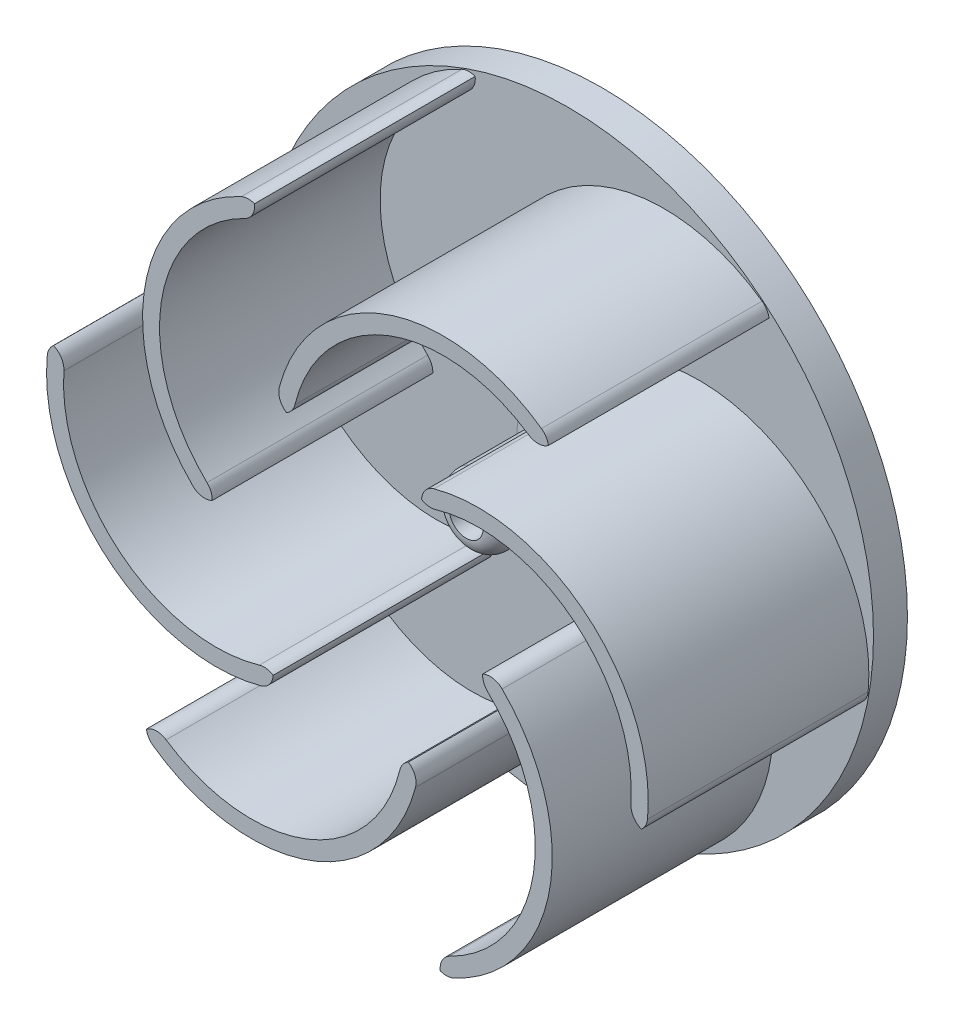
ISO-10303-21;
HEADER;
FILE_DESCRIPTION(('STEP AP214'),'2;1');
FILE_NAME('part.step','',(''),(''),'','','');
FILE_SCHEMA(('AUTOMOTIVE_DESIGN { 1 0 10303 214 1 1 1 1 }'));
ENDSEC;
DATA;
#1=APPLICATION_CONTEXT('core data for automotive mechanical design processes');
#2=APPLICATION_PROTOCOL_DEFINITION('international standard','automotive_design',2000,#1);
#3=PRODUCT_CONTEXT('',#1,'mechanical');
#4=PRODUCT('Part','Part','',(#3));
#5=PRODUCT_RELATED_PRODUCT_CATEGORY('part','',(#4));
#6=PRODUCT_DEFINITION_FORMATION('','',#4);
#7=PRODUCT_DEFINITION_CONTEXT('part definition',#1,'design');
#8=PRODUCT_DEFINITION('design','',#6,#7);
#9=PRODUCT_DEFINITION_SHAPE('','',#8);
#10=(LENGTH_UNIT() NAMED_UNIT(*) SI_UNIT(.MILLI.,.METRE.));
#11=(NAMED_UNIT(*) PLANE_ANGLE_UNIT() SI_UNIT($,.RADIAN.));
#12=(NAMED_UNIT(*) SI_UNIT($,.STERADIAN.) SOLID_ANGLE_UNIT());
#13=UNCERTAINTY_MEASURE_WITH_UNIT(LENGTH_MEASURE(1.E-05),#10,'distance_accuracy_value','');
#14=(GEOMETRIC_REPRESENTATION_CONTEXT(3) GLOBAL_UNCERTAINTY_ASSIGNED_CONTEXT((#13)) GLOBAL_UNIT_ASSIGNED_CONTEXT((#10,
#11,#12)) REPRESENTATION_CONTEXT('',''));
#15=CARTESIAN_POINT('',(0.,0.,0.));
#16=DIRECTION('',(0.,0.,1.));
#17=DIRECTION('',(1.,0.,0.));
#18=AXIS2_PLACEMENT_3D('',#15,#16,#17);
#19=CARTESIAN_POINT('',(0.,0.,0.));
#20=DIRECTION('',(0.,0.,1.));
#21=DIRECTION('',(1.,0.,0.));
#22=AXIS2_PLACEMENT_3D('',#19,#20,#21);
#23=PLANE('',#22);
#24=CARTESIAN_POINT('',(0.,0.,0.));
#25=DIRECTION('',(0.,0.,1.));
#26=DIRECTION('',(1.,0.,0.));
#27=AXIS2_PLACEMENT_3D('',#24,#25,#26);
#28=CIRCLE('',#27,3.);
#29=CARTESIAN_POINT('',(3.,0.,0.));
#30=VERTEX_POINT('',#29);
#31=EDGE_CURVE('E11',#30,#30,#28,.F.);
#32=ORIENTED_EDGE('',*,*,#31,.T.);
#33=EDGE_LOOP('',(#32));
#34=FACE_BOUND('',#33,.T.);
#35=CARTESIAN_POINT('',(4.90060391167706,7.52158955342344,0.));
#36=DIRECTION('',(0.,0.,1.));
#37=DIRECTION('',(1.,0.,0.));
#38=AXIS2_PLACEMENT_3D('',#35,#36,#37);
#39=CIRCLE('',#38,1.);
#40=CARTESIAN_POINT('',(5.18328418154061,6.56237536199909,0.));
#41=VERTEX_POINT('',#40);
#42=CARTESIAN_POINT('',(4.36936877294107,6.67436512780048,0.));
#43=VERTEX_POINT('',#42);
#44=EDGE_CURVE('E513',#41,#43,#39,.F.);
#45=ORIENTED_EDGE('',*,*,#44,.T.);
#46=CARTESIAN_POINT('',(5.36757897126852,6.61456211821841,0.));
#47=DIRECTION('',(0.,0.,1.));
#48=DIRECTION('',(1.,0.,0.));
#49=AXIS2_PLACEMENT_3D('',#46,#47,#48);
#50=CIRCLE('',#49,1.);
#51=CARTESIAN_POINT('',(5.10537590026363,7.57957483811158,0.));
#52=VERTEX_POINT('',#51);
#53=EDGE_CURVE('E59',#43,#52,#50,.F.);
#54=ORIENTED_EDGE('',*,*,#53,.T.);
#55=CARTESIAN_POINT('',(7.72740661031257,-2.07055236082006,0.));
#56=DIRECTION('',(0.,0.,1.));
#57=DIRECTION('',(0.50000000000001,-0.866025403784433,0.));
#58=AXIS2_PLACEMENT_3D('',#55,#56,#57);
#59=CIRCLE('',#58,10.);
#60=CARTESIAN_POINT('',(17.6848821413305,-2.99179122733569,0.));
#61=VERTEX_POINT('',#60);
#62=EDGE_CURVE('E622',#61,#52,#59,.T.);
#63=ORIENTED_EDGE('',*,*,#62,.F.);
#64=CARTESIAN_POINT('',(16.6891345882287,-2.89966734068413,0.));
#65=DIRECTION('',(0.,0.,1.));
#66=DIRECTION('',(1.,0.,0.));
#67=AXIS2_PLACEMENT_3D('',#64,#65,#66);
#68=CIRCLE('',#67,1.);
#69=CARTESIAN_POINT('',(17.3164357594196,-3.67844409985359,0.));
#70=VERTEX_POINT('',#69);
#71=EDGE_CURVE('E509',#61,#70,#68,.F.);
#72=ORIENTED_EDGE('',*,*,#71,.T.);
#73=CARTESIAN_POINT('',(17.7038500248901,-2.75653836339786,0.));
#74=DIRECTION('',(0.,0.,1.));
#75=DIRECTION('',(1.,0.,0.));
#76=AXIS2_PLACEMENT_3D('',#73,#74,#75);
#77=CIRCLE('',#76,1.);
#78=CARTESIAN_POINT('',(16.7062056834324,-2.68793976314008,0.));
#79=VERTEX_POINT('',#78);
#80=EDGE_CURVE('E599',#70,#79,#77,.F.);
#81=ORIENTED_EDGE('',*,*,#80,.T.);
#82=CARTESIAN_POINT('',(7.72740661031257,-2.07055236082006,0.));
#83=DIRECTION('',(0.,0.,-1.));
#84=DIRECTION('',(0.50000000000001,-0.866025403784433,0.));
#85=AXIS2_PLACEMENT_3D('',#82,#83,#84);
#86=CIRCLE('',#85,9.);
#87=EDGE_CURVE('E625',#41,#79,#86,.T.);
#88=ORIENTED_EDGE('',*,*,#87,.F.);
#89=EDGE_LOOP('',(#45,#54,#63,#72,#81,#88));
#90=FACE_BOUND('',#89,.T.);
#91=CARTESIAN_POINT('',(8.96418958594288,-0.483252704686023,0.));
#92=DIRECTION('',(0.,0.,1.));
#93=DIRECTION('',(1.,0.,0.));
#94=AXIS2_PLACEMENT_3D('',#91,#92,#93);
#95=CIRCLE('',#94,1.);
#96=CARTESIAN_POINT('',(8.27482586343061,-1.20766809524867,0.));
#97=VERTEX_POINT('',#96);
#98=CARTESIAN_POINT('',(7.96485414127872,-0.446801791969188,0.));
#99=VERTEX_POINT('',#98);
#100=EDGE_CURVE('E483',#97,#99,#95,.F.);
#101=ORIENTED_EDGE('',*,*,#100,.T.);
#102=CARTESIAN_POINT('',(8.41216831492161,-1.3411786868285,0.));
#103=DIRECTION('',(0.,0.,1.));
#104=DIRECTION('',(1.,0.,0.));
#105=AXIS2_PLACEMENT_3D('',#102,#103,#104);
#106=CIRCLE('',#105,1.);
#107=CARTESIAN_POINT('',(9.11679230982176,-0.631597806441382,0.));
#108=VERTEX_POINT('',#107);
#109=EDGE_CURVE('E585',#99,#108,#106,.F.);
#110=ORIENTED_EDGE('',*,*,#109,.T.);
#111=CARTESIAN_POINT('',(2.07055236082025,-7.72740661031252,0.));
#112=DIRECTION('',(0.,0.,1.));
#113=DIRECTION('',(-0.499999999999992,-0.866025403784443,0.));
#114=AXIS2_PLACEMENT_3D('',#111,#112,#113);
#115=CIRCLE('',#114,10.);
#116=CARTESIAN_POINT('',(6.25147386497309,-16.8114528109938,0.));
#117=VERTEX_POINT('',#116);
#118=EDGE_CURVE('E634',#117,#108,#115,.T.);
#119=ORIENTED_EDGE('',*,*,#118,.F.);
#120=CARTESIAN_POINT('',(5.8333817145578,-15.9030481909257,0.));
#121=DIRECTION('',(0.,0.,1.));
#122=DIRECTION('',(1.,0.,0.));
#123=AXIS2_PLACEMENT_3D('',#120,#121,#122);
#124=CIRCLE('',#123,1.);
#125=CARTESIAN_POINT('',(5.47259184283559,-16.8356953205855,0.));
#126=VERTEX_POINT('',#125);
#127=EDGE_CURVE('E479',#117,#126,#124,.F.);
#128=ORIENTED_EDGE('',*,*,#127,.T.);
#129=CARTESIAN_POINT('',(6.46469276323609,-16.7102530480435,0.));
#130=DIRECTION('',(0.,0.,1.));
#131=DIRECTION('',(1.,0.,0.));
#132=AXIS2_PLACEMENT_3D('',#129,#130,#131);
#133=CIRCLE('',#132,1.);
#134=CARTESIAN_POINT('',(6.0252787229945,-15.8119684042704,0.));
#135=VERTEX_POINT('',#134);
#136=EDGE_CURVE('E582',#126,#135,#133,.F.);
#137=ORIENTED_EDGE('',*,*,#136,.T.);
#138=CARTESIAN_POINT('',(2.07055236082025,-7.72740661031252,0.));
#139=DIRECTION('',(0.,0.,-1.));
#140=DIRECTION('',(-0.499999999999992,-0.866025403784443,0.));
#141=AXIS2_PLACEMENT_3D('',#138,#139,#140);
#142=CIRCLE('',#141,9.);
#143=EDGE_CURVE('E644',#97,#135,#142,.T.);
#144=ORIENTED_EDGE('',*,*,#143,.F.);
#145=EDGE_LOOP('',(#101,#110,#119,#128,#137,#144));
#146=FACE_BOUND('',#145,.T.);
#147=CARTESIAN_POINT('',(4.06358567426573,-8.00484225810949,0.));
#148=DIRECTION('',(0.,0.,1.));
#149=DIRECTION('',(1.,0.,0.));
#150=AXIS2_PLACEMENT_3D('',#147,#148,#149);
#151=CIRCLE('',#150,1.);
#152=CARTESIAN_POINT('',(3.09154168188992,-7.77004345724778,0.));
#153=VERTEX_POINT('',#152);
#154=CARTESIAN_POINT('',(3.59548536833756,-7.12116691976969,0.));
#155=VERTEX_POINT('',#154);
#156=EDGE_CURVE('E453',#153,#155,#151,.F.);
#157=ORIENTED_EDGE('',*,*,#156,.T.);
#158=CARTESIAN_POINT('',(3.044589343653,-7.95574080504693,0.));
#159=DIRECTION('',(0.,0.,1.));
#160=DIRECTION('',(1.,0.,0.));
#161=AXIS2_PLACEMENT_3D('',#158,#159,#160);
#162=CIRCLE('',#161,1.);
#163=CARTESIAN_POINT('',(4.01141640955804,-8.21117264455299,0.));
#164=VERTEX_POINT('',#163);
#165=EDGE_CURVE('E567',#155,#164,#162,.F.);
#166=ORIENTED_EDGE('',*,*,#165,.T.);
#167=CARTESIAN_POINT('',(-5.65685424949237,-5.65685424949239,0.));
#168=DIRECTION('',(0.,0.,1.));
#169=DIRECTION('',(-1.,0.,0.));
#170=AXIS2_PLACEMENT_3D('',#167,#168,#169);
#171=CIRCLE('',#170,10.);
#172=CARTESIAN_POINT('',(-11.4334082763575,-13.819661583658,0.));
#173=VERTEX_POINT('',#172);
#174=EDGE_CURVE('E648',#173,#164,#171,.T.);
#175=ORIENTED_EDGE('',*,*,#174,.F.);
#176=CARTESIAN_POINT('',(-10.855752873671,-13.0033808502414,0.));
#177=DIRECTION('',(0.,0.,1.));
#178=DIRECTION('',(1.,0.,0.));
#179=AXIS2_PLACEMENT_3D('',#176,#177,#178);
#180=CIRCLE('',#179,1.);
#181=CARTESIAN_POINT('',(-11.8438439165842,-13.1572512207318,0.));
#182=VERTEX_POINT('',#181);
#183=EDGE_CURVE('E449',#173,#182,#180,.F.);
#184=ORIENTED_EDGE('',*,*,#183,.T.);
#185=CARTESIAN_POINT('',(-11.2391572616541,-13.9537146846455,0.));
#186=DIRECTION('',(0.,0.,1.));
#187=DIRECTION('',(1.,0.,0.));
#188=AXIS2_PLACEMENT_3D('',#185,#186,#187);
#189=CIRCLE('',#188,1.);
#190=CARTESIAN_POINT('',(-10.680926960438,-13.1240286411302,0.));
#191=VERTEX_POINT('',#190);
#192=EDGE_CURVE('E564',#182,#191,#189,.F.);
#193=ORIENTED_EDGE('',*,*,#192,.T.);
#194=CARTESIAN_POINT('',(-5.65685424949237,-5.65685424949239,0.));
#195=DIRECTION('',(0.,0.,-1.));
#196=DIRECTION('',(-1.,0.,0.));
#197=AXIS2_PLACEMENT_3D('',#194,#195,#196);
#198=CIRCLE('',#197,9.);
#199=EDGE_CURVE('E660',#153,#191,#198,.T.);
#200=ORIENTED_EDGE('',*,*,#199,.F.);
#201=EDGE_LOOP('',(#157,#166,#175,#184,#193,#200));
#202=FACE_BOUND('',#201,.T.);
#203=CARTESIAN_POINT('',(-4.90060391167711,-7.5215895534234,0.));
#204=DIRECTION('',(0.,0.,1.));
#205=DIRECTION('',(1.,0.,0.));
#206=AXIS2_PLACEMENT_3D('',#203,#204,#205);
#207=CIRCLE('',#206,1.);
#208=CARTESIAN_POINT('',(-5.18328418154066,-6.56237536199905,0.));
#209=VERTEX_POINT('',#208);
#210=CARTESIAN_POINT('',(-4.36936877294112,-6.67436512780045,0.));
#211=VERTEX_POINT('',#210);
#212=EDGE_CURVE('E423',#209,#211,#207,.F.);
#213=ORIENTED_EDGE('',*,*,#212,.T.);
#214=CARTESIAN_POINT('',(-5.36757897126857,-6.61456211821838,0.));
#215=DIRECTION('',(0.,0.,1.));
#216=DIRECTION('',(1.,0.,0.));
#217=AXIS2_PLACEMENT_3D('',#214,#215,#216);
#218=CIRCLE('',#217,1.);
#219=CARTESIAN_POINT('',(-5.10537590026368,-7.57957483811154,0.));
#220=VERTEX_POINT('',#219);
#221=EDGE_CURVE('E549',#211,#220,#218,.F.);
#222=ORIENTED_EDGE('',*,*,#221,.T.);
#223=CARTESIAN_POINT('',(-7.72740661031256,2.07055236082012,0.));
#224=DIRECTION('',(0.,0.,1.));
#225=DIRECTION('',(-0.500000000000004,0.866025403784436,0.));
#226=AXIS2_PLACEMENT_3D('',#223,#224,#225);
#227=CIRCLE('',#226,10.);
#228=CARTESIAN_POINT('',(-17.6848821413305,2.99179122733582,0.));
#229=VERTEX_POINT('',#228);
#230=EDGE_CURVE('E664',#229,#220,#227,.T.);
#231=ORIENTED_EDGE('',*,*,#230,.F.);
#232=CARTESIAN_POINT('',(-16.6891345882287,2.89966734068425,0.));
#233=DIRECTION('',(0.,0.,1.));
#234=DIRECTION('',(1.,0.,0.));
#235=AXIS2_PLACEMENT_3D('',#232,#233,#234);
#236=CIRCLE('',#235,1.);
#237=CARTESIAN_POINT('',(-17.3164357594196,3.67844409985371,0.));
#238=VERTEX_POINT('',#237);
#239=EDGE_CURVE('E419',#229,#238,#236,.F.);
#240=ORIENTED_EDGE('',*,*,#239,.T.);
#241=CARTESIAN_POINT('',(-17.7038500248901,2.75653836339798,0.));
#242=DIRECTION('',(0.,0.,1.));
#243=DIRECTION('',(1.,0.,0.));
#244=AXIS2_PLACEMENT_3D('',#241,#242,#243);
#245=CIRCLE('',#244,1.);
#246=CARTESIAN_POINT('',(-16.7062056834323,2.6879397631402,0.));
#247=VERTEX_POINT('',#246);
#248=EDGE_CURVE('E546',#238,#247,#245,.F.);
#249=ORIENTED_EDGE('',*,*,#248,.T.);
#250=CARTESIAN_POINT('',(-7.72740661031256,2.07055236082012,0.));
#251=DIRECTION('',(0.,0.,-1.));
#252=DIRECTION('',(-0.500000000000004,0.866025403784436,0.));
#253=AXIS2_PLACEMENT_3D('',#250,#251,#252);
#254=CIRCLE('',#253,9.);
#255=EDGE_CURVE('E676',#209,#247,#254,.T.);
#256=ORIENTED_EDGE('',*,*,#255,.F.);
#257=EDGE_LOOP('',(#213,#222,#231,#240,#249,#256));
#258=FACE_BOUND('',#257,.T.);
#259=CARTESIAN_POINT('',(-8.96418958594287,0.483252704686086,0.));
#260=DIRECTION('',(0.,0.,1.));
#261=DIRECTION('',(1.,0.,0.));
#262=AXIS2_PLACEMENT_3D('',#259,#260,#261);
#263=CIRCLE('',#262,1.);
#264=CARTESIAN_POINT('',(-8.27482586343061,1.20766809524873,0.));
#265=VERTEX_POINT('',#264);
#266=CARTESIAN_POINT('',(-7.96485414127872,0.446801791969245,0.));
#267=VERTEX_POINT('',#266);
#268=EDGE_CURVE('E393',#265,#267,#263,.F.);
#269=ORIENTED_EDGE('',*,*,#268,.T.);
#270=CARTESIAN_POINT('',(-8.4121683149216,1.34117868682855,0.));
#271=DIRECTION('',(0.,0.,1.));
#272=DIRECTION('',(1.,0.,0.));
#273=AXIS2_PLACEMENT_3D('',#270,#271,#272);
#274=CIRCLE('',#273,1.);
#275=CARTESIAN_POINT('',(-9.11679230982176,0.631597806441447,0.));
#276=VERTEX_POINT('',#275);
#277=EDGE_CURVE('E531',#267,#276,#274,.F.);
#278=ORIENTED_EDGE('',*,*,#277,.T.);
#279=CARTESIAN_POINT('',(-2.0705523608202,7.72740661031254,0.));
#280=DIRECTION('',(0.,0.,1.));
#281=DIRECTION('',(0.499999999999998,0.86602540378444,0.));
#282=AXIS2_PLACEMENT_3D('',#279,#280,#281);
#283=CIRCLE('',#282,10.);
#284=CARTESIAN_POINT('',(-6.25147386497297,16.8114528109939,0.));
#285=VERTEX_POINT('',#284);
#286=EDGE_CURVE('E680',#285,#276,#283,.T.);
#287=ORIENTED_EDGE('',*,*,#286,.F.);
#288=CARTESIAN_POINT('',(-5.8333817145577,15.9030481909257,0.));
#289=DIRECTION('',(0.,0.,1.));
#290=DIRECTION('',(1.,0.,0.));
#291=AXIS2_PLACEMENT_3D('',#288,#289,#290);
#292=CIRCLE('',#291,1.);
#293=CARTESIAN_POINT('',(-5.47259184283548,16.8356953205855,0.));
#294=VERTEX_POINT('',#293);
#295=EDGE_CURVE('E389',#285,#294,#292,.F.);
#296=ORIENTED_EDGE('',*,*,#295,.T.);
#297=CARTESIAN_POINT('',(-6.46469276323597,16.7102530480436,0.));
#298=DIRECTION('',(0.,0.,1.));
#299=DIRECTION('',(1.,0.,0.));
#300=AXIS2_PLACEMENT_3D('',#297,#298,#299);
#301=CIRCLE('',#300,1.);
#302=CARTESIAN_POINT('',(-6.02527872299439,15.8119684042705,0.));
#303=VERTEX_POINT('',#302);
#304=EDGE_CURVE('E528',#294,#303,#301,.F.);
#305=ORIENTED_EDGE('',*,*,#304,.T.);
#306=CARTESIAN_POINT('',(-2.0705523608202,7.72740661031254,0.));
#307=DIRECTION('',(0.,0.,-1.));
#308=DIRECTION('',(0.499999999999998,0.86602540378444,0.));
#309=AXIS2_PLACEMENT_3D('',#306,#307,#308);
#310=CIRCLE('',#309,9.);
#311=EDGE_CURVE('E689',#265,#303,#310,.T.);
#312=ORIENTED_EDGE('',*,*,#311,.F.);
#313=EDGE_LOOP('',(#269,#278,#287,#296,#305,#312));
#314=FACE_BOUND('',#313,.T.);
#315=CARTESIAN_POINT('',(-4.06358567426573,8.00484225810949,0.));
#316=DIRECTION('',(0.,0.,1.));
#317=DIRECTION('',(1.,0.,0.));
#318=AXIS2_PLACEMENT_3D('',#315,#316,#317);
#319=CIRCLE('',#318,1.);
#320=CARTESIAN_POINT('',(-3.09154168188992,7.77004345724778,0.));
#321=VERTEX_POINT('',#320);
#322=CARTESIAN_POINT('',(-3.59548536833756,7.12116691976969,0.));
#323=VERTEX_POINT('',#322);
#324=EDGE_CURVE('E290',#321,#323,#319,.F.);
#325=ORIENTED_EDGE('',*,*,#324,.T.);
#326=CARTESIAN_POINT('',(-3.044589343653,7.95574080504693,0.));
#327=DIRECTION('',(0.,0.,1.));
#328=DIRECTION('',(1.,0.,0.));
#329=AXIS2_PLACEMENT_3D('',#326,#327,#328);
#330=CIRCLE('',#329,1.);
#331=CARTESIAN_POINT('',(-4.01141640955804,8.21117264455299,0.));
#332=VERTEX_POINT('',#331);
#333=EDGE_CURVE('E306',#323,#332,#330,.F.);
#334=ORIENTED_EDGE('',*,*,#333,.T.);
#335=CARTESIAN_POINT('',(5.65685424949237,5.65685424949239,0.));
#336=DIRECTION('',(0.,0.,1.));
#337=DIRECTION('',(1.,0.,0.));
#338=AXIS2_PLACEMENT_3D('',#335,#336,#337);
#339=CIRCLE('',#338,10.);
#340=CARTESIAN_POINT('',(11.4334082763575,13.819661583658,0.));
#341=VERTEX_POINT('',#340);
#342=EDGE_CURVE('E297',#341,#332,#339,.T.);
#343=ORIENTED_EDGE('',*,*,#342,.F.);
#344=CARTESIAN_POINT('',(10.855752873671,13.0033808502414,0.));
#345=DIRECTION('',(0.,0.,1.));
#346=DIRECTION('',(1.,0.,0.));
#347=AXIS2_PLACEMENT_3D('',#344,#345,#346);
#348=CIRCLE('',#347,1.);
#349=CARTESIAN_POINT('',(11.8438439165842,13.1572512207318,0.));
#350=VERTEX_POINT('',#349);
#351=EDGE_CURVE('E280',#341,#350,#348,.F.);
#352=ORIENTED_EDGE('',*,*,#351,.T.);
#353=CARTESIAN_POINT('',(11.2391572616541,13.9537146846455,0.));
#354=DIRECTION('',(0.,0.,1.));
#355=DIRECTION('',(1.,0.,0.));
#356=AXIS2_PLACEMENT_3D('',#353,#354,#355);
#357=CIRCLE('',#356,1.);
#358=CARTESIAN_POINT('',(10.680926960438,13.1240286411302,0.));
#359=VERTEX_POINT('',#358);
#360=EDGE_CURVE('E362',#350,#359,#357,.F.);
#361=ORIENTED_EDGE('',*,*,#360,.T.);
#362=CARTESIAN_POINT('',(5.65685424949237,5.65685424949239,0.));
#363=DIRECTION('',(0.,0.,-1.));
#364=DIRECTION('',(1.,0.,0.));
#365=AXIS2_PLACEMENT_3D('',#362,#363,#364);
#366=CIRCLE('',#365,9.);
#367=EDGE_CURVE('E308',#321,#359,#366,.T.);
#368=ORIENTED_EDGE('',*,*,#367,.F.);
#369=EDGE_LOOP('',(#325,#334,#343,#352,#361,#368));
#370=FACE_BOUND('',#369,.T.);
#371=CARTESIAN_POINT('',(0.,0.,0.));
#372=DIRECTION('',(0.,0.,1.));
#373=DIRECTION('',(1.,0.,0.));
#374=AXIS2_PLACEMENT_3D('',#371,#372,#373);
#375=CIRCLE('',#374,18.);
#376=CARTESIAN_POINT('',(18.,0.,0.));
#377=VERTEX_POINT('',#376);
#378=EDGE_CURVE('E326',#377,#377,#375,.T.);
#379=ORIENTED_EDGE('',*,*,#378,.T.);
#380=EDGE_LOOP('',(#379));
#381=FACE_BOUND('',#380,.T.);
#382=ADVANCED_FACE('F43',(#34,#90,#146,#202,#258,#314,#370,#381),#23,.T.);
#383=CARTESIAN_POINT('',(0.,0.,-2.));
#384=DIRECTION('',(0.,0.,1.));
#385=DIRECTION('',(1.,0.,0.));
#386=AXIS2_PLACEMENT_3D('',#383,#384,#385);
#387=CYLINDRICAL_SURFACE('',#386,18.);
#388=CARTESIAN_POINT('',(0.,0.,-2.));
#389=DIRECTION('',(0.,0.,1.));
#390=DIRECTION('',(1.,0.,0.));
#391=AXIS2_PLACEMENT_3D('',#388,#389,#390);
#392=CIRCLE('',#391,18.);
#393=CARTESIAN_POINT('',(18.,0.,-2.));
#394=VERTEX_POINT('',#393);
#395=EDGE_CURVE('E302',#394,#394,#392,.T.);
#396=ORIENTED_EDGE('',*,*,#395,.T.);
#397=EDGE_LOOP('',(#396));
#398=FACE_BOUND('',#397,.T.);
#399=ORIENTED_EDGE('',*,*,#378,.F.);
#400=EDGE_LOOP('',(#399));
#401=FACE_BOUND('',#400,.T.);
#402=ADVANCED_FACE('F730',(#398,#401),#387,.T.);
#403=CARTESIAN_POINT('',(0.,0.,-2.));
#404=DIRECTION('',(0.,0.,1.));
#405=DIRECTION('',(1.,0.,0.));
#406=AXIS2_PLACEMENT_3D('',#403,#404,#405);
#407=PLANE('',#406);
#408=CARTESIAN_POINT('',(0.,0.,-2.));
#409=DIRECTION('',(0.,0.,1.));
#410=DIRECTION('',(1.,0.,0.));
#411=AXIS2_PLACEMENT_3D('',#408,#409,#410);
#412=CIRCLE('',#411,1.);
#413=CARTESIAN_POINT('',(1.,0.,-2.));
#414=VERTEX_POINT('',#413);
#415=EDGE_CURVE('E322',#414,#414,#412,.T.);
#416=ORIENTED_EDGE('',*,*,#415,.T.);
#417=EDGE_LOOP('',(#416));
#418=FACE_BOUND('',#417,.T.);
#419=ORIENTED_EDGE('',*,*,#395,.F.);
#420=EDGE_LOOP('',(#419));
#421=FACE_BOUND('',#420,.T.);
#422=ADVANCED_FACE('F736',(#418,#421),#407,.F.);
#423=CARTESIAN_POINT('',(0.,0.,-2.));
#424=DIRECTION('',(0.,0.,1.));
#425=DIRECTION('',(1.,0.,0.));
#426=AXIS2_PLACEMENT_3D('',#423,#424,#425);
#427=CYLINDRICAL_SURFACE('',#426,1.);
#428=ORIENTED_EDGE('',*,*,#415,.F.);
#429=EDGE_LOOP('',(#428));
#430=FACE_BOUND('',#429,.T.);
#431=CARTESIAN_POINT('',(0.,0.,6.));
#432=DIRECTION('',(0.,0.,1.));
#433=DIRECTION('',(1.,0.,0.));
#434=AXIS2_PLACEMENT_3D('',#431,#432,#433);
#435=CIRCLE('',#434,1.);
#436=CARTESIAN_POINT('',(1.,0.,6.));
#437=VERTEX_POINT('',#436);
#438=EDGE_CURVE('E619',#437,#437,#435,.T.);
#439=ORIENTED_EDGE('',*,*,#438,.T.);
#440=EDGE_LOOP('',(#439));
#441=FACE_BOUND('',#440,.T.);
#442=ADVANCED_FACE('F1145',(#430,#441),#427,.F.);
#443=CARTESIAN_POINT('',(5.65685424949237,5.65685424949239,13.));
#444=DIRECTION('',(0.,0.,-1.));
#445=DIRECTION('',(-1.,0.,0.));
#446=AXIS2_PLACEMENT_3D('',#443,#444,#445);
#447=CYLINDRICAL_SURFACE('',#446,10.);
#448=ORIENTED_EDGE('',*,*,#342,.T.);
#449=DIRECTION('',(0.,0.,-1.));
#450=VECTOR('',#449,1.);
#451=CARTESIAN_POINT('',(-4.01141640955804,8.21117264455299,13.));
#452=LINE('',#451,#450);
#453=CARTESIAN_POINT('',(-4.01141640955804,8.21117264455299,13.));
#454=VERTEX_POINT('',#453);
#455=EDGE_CURVE('E359',#332,#454,#452,.F.);
#456=ORIENTED_EDGE('',*,*,#455,.T.);
#457=CARTESIAN_POINT('',(5.65685424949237,5.65685424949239,13.));
#458=DIRECTION('',(0.,0.,1.));
#459=DIRECTION('',(1.,0.,0.));
#460=AXIS2_PLACEMENT_3D('',#457,#458,#459);
#461=CIRCLE('',#460,10.);
#462=CARTESIAN_POINT('',(11.4334082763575,13.819661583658,13.));
#463=VERTEX_POINT('',#462);
#464=EDGE_CURVE('E300',#463,#454,#461,.T.);
#465=ORIENTED_EDGE('',*,*,#464,.F.);
#466=DIRECTION('',(0.,0.,-1.));
#467=VECTOR('',#466,1.);
#468=CARTESIAN_POINT('',(11.4334082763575,13.819661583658,13.));
#469=LINE('',#468,#467);
#470=EDGE_CURVE('E284',#463,#341,#469,.T.);
#471=ORIENTED_EDGE('',*,*,#470,.T.);
#472=EDGE_LOOP('',(#448,#456,#465,#471));
#473=FACE_BOUND('',#472,.T.);
#474=ADVANCED_FACE('F296',(#473),#447,.T.);
#475=CARTESIAN_POINT('',(5.65685424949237,5.65685424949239,13.));
#476=DIRECTION('',(0.,0.,-1.));
#477=DIRECTION('',(-1.,0.,0.));
#478=AXIS2_PLACEMENT_3D('',#475,#476,#477);
#479=CYLINDRICAL_SURFACE('',#478,9.);
#480=ORIENTED_EDGE('',*,*,#367,.T.);
#481=DIRECTION('',(0.,0.,-1.));
#482=VECTOR('',#481,1.);
#483=CARTESIAN_POINT('',(10.680926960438,13.1240286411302,13.));
#484=LINE('',#483,#482);
#485=CARTESIAN_POINT('',(10.680926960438,13.1240286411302,13.));
#486=VERTEX_POINT('',#485);
#487=EDGE_CURVE('E350',#359,#486,#484,.F.);
#488=ORIENTED_EDGE('',*,*,#487,.T.);
#489=CARTESIAN_POINT('',(5.65685424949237,5.65685424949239,13.));
#490=DIRECTION('',(0.,0.,-1.));
#491=DIRECTION('',(1.,0.,0.));
#492=AXIS2_PLACEMENT_3D('',#489,#490,#491);
#493=CIRCLE('',#492,9.);
#494=CARTESIAN_POINT('',(-3.09154168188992,7.77004345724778,13.));
#495=VERTEX_POINT('',#494);
#496=EDGE_CURVE('E319',#495,#486,#493,.T.);
#497=ORIENTED_EDGE('',*,*,#496,.F.);
#498=DIRECTION('',(0.,0.,-1.));
#499=VECTOR('',#498,1.);
#500=CARTESIAN_POINT('',(-3.09154168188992,7.77004345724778,13.));
#501=LINE('',#500,#499);
#502=EDGE_CURVE('E341',#495,#321,#501,.T.);
#503=ORIENTED_EDGE('',*,*,#502,.T.);
#504=EDGE_LOOP('',(#480,#488,#497,#503));
#505=FACE_BOUND('',#504,.T.);
#506=ADVANCED_FACE('F711',(#505),#479,.F.);
#507=CARTESIAN_POINT('',(5.65685424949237,5.65685424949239,13.));
#508=DIRECTION('',(0.,0.,1.));
#509=DIRECTION('',(1.,0.,0.));
#510=AXIS2_PLACEMENT_3D('',#507,#508,#509);
#511=PLANE('',#510);
#512=ORIENTED_EDGE('',*,*,#496,.T.);
#513=CARTESIAN_POINT('',(11.2391572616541,13.9537146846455,13.));
#514=DIRECTION('',(0.,0.,1.));
#515=DIRECTION('',(1.,0.,0.));
#516=AXIS2_PLACEMENT_3D('',#513,#514,#515);
#517=CIRCLE('',#516,1.);
#518=CARTESIAN_POINT('',(11.8438439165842,13.1572512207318,13.));
#519=VERTEX_POINT('',#518);
#520=EDGE_CURVE('E356',#486,#519,#517,.T.);
#521=ORIENTED_EDGE('',*,*,#520,.T.);
#522=CARTESIAN_POINT('',(10.855752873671,13.0033808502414,13.));
#523=DIRECTION('',(0.,0.,1.));
#524=DIRECTION('',(1.,0.,0.));
#525=AXIS2_PLACEMENT_3D('',#522,#523,#524);
#526=CIRCLE('',#525,1.);
#527=EDGE_CURVE('E338',#519,#463,#526,.T.);
#528=ORIENTED_EDGE('',*,*,#527,.T.);
#529=ORIENTED_EDGE('',*,*,#464,.T.);
#530=CARTESIAN_POINT('',(-3.044589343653,7.95574080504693,13.));
#531=DIRECTION('',(0.,0.,1.));
#532=DIRECTION('',(1.,0.,0.));
#533=AXIS2_PLACEMENT_3D('',#530,#531,#532);
#534=CIRCLE('',#533,1.);
#535=CARTESIAN_POINT('',(-3.59548536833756,7.12116691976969,13.));
#536=VERTEX_POINT('',#535);
#537=EDGE_CURVE('E353',#454,#536,#534,.T.);
#538=ORIENTED_EDGE('',*,*,#537,.T.);
#539=CARTESIAN_POINT('',(-4.06358567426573,8.00484225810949,13.));
#540=DIRECTION('',(0.,0.,1.));
#541=DIRECTION('',(1.,0.,0.));
#542=AXIS2_PLACEMENT_3D('',#539,#540,#541);
#543=CIRCLE('',#542,1.);
#544=EDGE_CURVE('E335',#536,#495,#543,.T.);
#545=ORIENTED_EDGE('',*,*,#544,.T.);
#546=EDGE_LOOP('',(#512,#521,#528,#529,#538,#545));
#547=FACE_BOUND('',#546,.T.);
#548=ADVANCED_FACE('F703',(#547),#511,.T.);
#549=CARTESIAN_POINT('',(10.855752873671,13.0033808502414,13.));
#550=DIRECTION('',(0.,0.,-1.));
#551=DIRECTION('',(-1.,0.,0.));
#552=AXIS2_PLACEMENT_3D('',#549,#550,#551);
#553=CYLINDRICAL_SURFACE('',#552,1.);
#554=ORIENTED_EDGE('',*,*,#527,.F.);
#555=DIRECTION('',(0.,0.,-1.));
#556=VECTOR('',#555,1.);
#557=CARTESIAN_POINT('',(11.8438439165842,13.1572512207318,13.));
#558=LINE('',#557,#556);
#559=EDGE_CURVE('E286',#350,#519,#558,.F.);
#560=ORIENTED_EDGE('',*,*,#559,.F.);
#561=ORIENTED_EDGE('',*,*,#351,.F.);
#562=ORIENTED_EDGE('',*,*,#470,.F.);
#563=EDGE_LOOP('',(#554,#560,#561,#562));
#564=FACE_BOUND('',#563,.T.);
#565=ADVANCED_FACE('F283',(#564),#553,.T.);
#566=CARTESIAN_POINT('',(-4.06358567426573,8.00484225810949,13.));
#567=DIRECTION('',(0.,0.,-1.));
#568=DIRECTION('',(-1.,0.,0.));
#569=AXIS2_PLACEMENT_3D('',#566,#567,#568);
#570=CYLINDRICAL_SURFACE('',#569,1.);
#571=ORIENTED_EDGE('',*,*,#544,.F.);
#572=DIRECTION('',(0.,0.,-1.));
#573=VECTOR('',#572,1.);
#574=CARTESIAN_POINT('',(-3.59548536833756,7.12116691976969,13.));
#575=LINE('',#574,#573);
#576=EDGE_CURVE('E291',#323,#536,#575,.F.);
#577=ORIENTED_EDGE('',*,*,#576,.F.);
#578=ORIENTED_EDGE('',*,*,#324,.F.);
#579=ORIENTED_EDGE('',*,*,#502,.F.);
#580=EDGE_LOOP('',(#571,#577,#578,#579));
#581=FACE_BOUND('',#580,.T.);
#582=ADVANCED_FACE('F713',(#581),#570,.T.);
#583=CARTESIAN_POINT('',(11.2391572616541,13.9537146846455,13.));
#584=DIRECTION('',(0.,0.,-1.));
#585=DIRECTION('',(-1.,0.,0.));
#586=AXIS2_PLACEMENT_3D('',#583,#584,#585);
#587=CYLINDRICAL_SURFACE('',#586,1.);
#588=ORIENTED_EDGE('',*,*,#520,.F.);
#589=ORIENTED_EDGE('',*,*,#487,.F.);
#590=ORIENTED_EDGE('',*,*,#360,.F.);
#591=ORIENTED_EDGE('',*,*,#559,.T.);
#592=EDGE_LOOP('',(#588,#589,#590,#591));
#593=FACE_BOUND('',#592,.T.);
#594=ADVANCED_FACE('F709',(#593),#587,.T.);
#595=CARTESIAN_POINT('',(-3.044589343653,7.95574080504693,13.));
#596=DIRECTION('',(0.,0.,1.));
#597=DIRECTION('',(1.,0.,0.));
#598=AXIS2_PLACEMENT_3D('',#595,#596,#597);
#599=CYLINDRICAL_SURFACE('',#598,1.);
#600=ORIENTED_EDGE('',*,*,#537,.F.);
#601=ORIENTED_EDGE('',*,*,#455,.F.);
#602=ORIENTED_EDGE('',*,*,#333,.F.);
#603=ORIENTED_EDGE('',*,*,#576,.T.);
#604=EDGE_LOOP('',(#600,#601,#602,#603));
#605=FACE_BOUND('',#604,.T.);
#606=ADVANCED_FACE('F716',(#605),#599,.T.);
#607=CARTESIAN_POINT('',(-2.0705523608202,7.72740661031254,13.));
#608=DIRECTION('',(0.,0.,-1.));
#609=DIRECTION('',(-1.,0.,0.));
#610=AXIS2_PLACEMENT_3D('',#607,#608,#609);
#611=CYLINDRICAL_SURFACE('',#610,10.);
#612=ORIENTED_EDGE('',*,*,#286,.T.);
#613=DIRECTION('',(0.,0.,-1.));
#614=VECTOR('',#613,1.);
#615=CARTESIAN_POINT('',(-9.11679230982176,0.631597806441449,13.));
#616=LINE('',#615,#614);
#617=CARTESIAN_POINT('',(-9.11679230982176,0.631597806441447,13.));
#618=VERTEX_POINT('',#617);
#619=EDGE_CURVE('E525',#276,#618,#616,.F.);
#620=ORIENTED_EDGE('',*,*,#619,.T.);
#621=CARTESIAN_POINT('',(-2.0705523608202,7.72740661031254,13.));
#622=DIRECTION('',(0.,0.,1.));
#623=DIRECTION('',(0.499999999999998,0.86602540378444,0.));
#624=AXIS2_PLACEMENT_3D('',#621,#622,#623);
#625=CIRCLE('',#624,10.);
#626=CARTESIAN_POINT('',(-6.25147386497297,16.8114528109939,13.));
#627=VERTEX_POINT('',#626);
#628=EDGE_CURVE('E316',#627,#618,#625,.T.);
#629=ORIENTED_EDGE('',*,*,#628,.F.);
#630=DIRECTION('',(0.,0.,-1.));
#631=VECTOR('',#630,1.);
#632=CARTESIAN_POINT('',(-6.25147386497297,16.8114528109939,13.));
#633=LINE('',#632,#631);
#634=EDGE_CURVE('E367',#627,#285,#633,.T.);
#635=ORIENTED_EDGE('',*,*,#634,.T.);
#636=EDGE_LOOP('',(#612,#620,#629,#635));
#637=FACE_BOUND('',#636,.T.);
#638=ADVANCED_FACE('F718',(#637),#611,.T.);
#639=CARTESIAN_POINT('',(-2.0705523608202,7.72740661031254,13.));
#640=DIRECTION('',(0.,0.,-1.));
#641=DIRECTION('',(-1.,0.,0.));
#642=AXIS2_PLACEMENT_3D('',#639,#640,#641);
#643=CYLINDRICAL_SURFACE('',#642,9.);
#644=ORIENTED_EDGE('',*,*,#311,.T.);
#645=DIRECTION('',(0.,0.,-1.));
#646=VECTOR('',#645,1.);
#647=CARTESIAN_POINT('',(-6.0252787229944,15.8119684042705,13.));
#648=LINE('',#647,#646);
#649=CARTESIAN_POINT('',(-6.02527872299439,15.8119684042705,13.));
#650=VERTEX_POINT('',#649);
#651=EDGE_CURVE('E516',#303,#650,#648,.F.);
#652=ORIENTED_EDGE('',*,*,#651,.T.);
#653=CARTESIAN_POINT('',(-2.0705523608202,7.72740661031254,13.));
#654=DIRECTION('',(0.,0.,-1.));
#655=DIRECTION('',(0.499999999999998,0.86602540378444,0.));
#656=AXIS2_PLACEMENT_3D('',#653,#654,#655);
#657=CIRCLE('',#656,9.);
#658=CARTESIAN_POINT('',(-8.27482586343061,1.20766809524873,13.));
#659=VERTEX_POINT('',#658);
#660=EDGE_CURVE('E309',#659,#650,#657,.T.);
#661=ORIENTED_EDGE('',*,*,#660,.F.);
#662=DIRECTION('',(0.,0.,-1.));
#663=VECTOR('',#662,1.);
#664=CARTESIAN_POINT('',(-8.27482586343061,1.20766809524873,13.));
#665=LINE('',#664,#663);
#666=EDGE_CURVE('E381',#659,#265,#665,.T.);
#667=ORIENTED_EDGE('',*,*,#666,.T.);
#668=EDGE_LOOP('',(#644,#652,#661,#667));
#669=FACE_BOUND('',#668,.T.);
#670=ADVANCED_FACE('F724',(#669),#643,.F.);
#671=CARTESIAN_POINT('',(-2.0705523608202,7.72740661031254,13.));
#672=DIRECTION('',(0.,0.,1.));
#673=DIRECTION('',(0.499999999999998,0.86602540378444,0.));
#674=AXIS2_PLACEMENT_3D('',#671,#672,#673);
#675=PLANE('',#674);
#676=ORIENTED_EDGE('',*,*,#660,.T.);
#677=CARTESIAN_POINT('',(-6.46469276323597,16.7102530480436,13.));
#678=DIRECTION('',(0.,0.,1.));
#679=DIRECTION('',(1.,0.,0.));
#680=AXIS2_PLACEMENT_3D('',#677,#678,#679);
#681=CIRCLE('',#680,1.);
#682=CARTESIAN_POINT('',(-5.47259184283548,16.8356953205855,13.));
#683=VERTEX_POINT('',#682);
#684=EDGE_CURVE('E522',#650,#683,#681,.T.);
#685=ORIENTED_EDGE('',*,*,#684,.T.);
#686=CARTESIAN_POINT('',(-5.8333817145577,15.9030481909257,13.));
#687=DIRECTION('',(0.,0.,1.));
#688=DIRECTION('',(1.,0.,0.));
#689=AXIS2_PLACEMENT_3D('',#686,#687,#688);
#690=CIRCLE('',#689,1.);
#691=EDGE_CURVE('E378',#683,#627,#690,.T.);
#692=ORIENTED_EDGE('',*,*,#691,.T.);
#693=ORIENTED_EDGE('',*,*,#628,.T.);
#694=CARTESIAN_POINT('',(-8.4121683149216,1.34117868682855,13.));
#695=DIRECTION('',(0.,0.,1.));
#696=DIRECTION('',(1.,0.,0.));
#697=AXIS2_PLACEMENT_3D('',#694,#695,#696);
#698=CIRCLE('',#697,1.);
#699=CARTESIAN_POINT('',(-7.96485414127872,0.446801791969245,13.));
#700=VERTEX_POINT('',#699);
#701=EDGE_CURVE('E519',#618,#700,#698,.T.);
#702=ORIENTED_EDGE('',*,*,#701,.T.);
#703=CARTESIAN_POINT('',(-8.96418958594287,0.483252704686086,13.));
#704=DIRECTION('',(0.,0.,1.));
#705=DIRECTION('',(1.,0.,0.));
#706=AXIS2_PLACEMENT_3D('',#703,#704,#705);
#707=CIRCLE('',#706,1.);
#708=EDGE_CURVE('E375',#700,#659,#707,.T.);
#709=ORIENTED_EDGE('',*,*,#708,.T.);
#710=EDGE_LOOP('',(#676,#685,#692,#693,#702,#709));
#711=FACE_BOUND('',#710,.T.);
#712=ADVANCED_FACE('F776',(#711),#675,.T.);
#713=CARTESIAN_POINT('',(-7.72740661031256,2.07055236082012,13.));
#714=DIRECTION('',(0.,0.,-1.));
#715=DIRECTION('',(-1.,0.,0.));
#716=AXIS2_PLACEMENT_3D('',#713,#714,#715);
#717=CYLINDRICAL_SURFACE('',#716,10.);
#718=ORIENTED_EDGE('',*,*,#230,.T.);
#719=DIRECTION('',(0.,0.,-1.));
#720=VECTOR('',#719,1.);
#721=CARTESIAN_POINT('',(-5.10537590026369,-7.57957483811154,13.));
#722=LINE('',#721,#720);
#723=CARTESIAN_POINT('',(-5.10537590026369,-7.57957483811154,13.));
#724=VERTEX_POINT('',#723);
#725=EDGE_CURVE('E543',#220,#724,#722,.F.);
#726=ORIENTED_EDGE('',*,*,#725,.T.);
#727=CARTESIAN_POINT('',(-7.72740661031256,2.07055236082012,13.));
#728=DIRECTION('',(0.,0.,1.));
#729=DIRECTION('',(-0.500000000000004,0.866025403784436,0.));
#730=AXIS2_PLACEMENT_3D('',#727,#728,#729);
#731=CIRCLE('',#730,10.);
#732=CARTESIAN_POINT('',(-17.6848821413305,2.99179122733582,13.));
#733=VERTEX_POINT('',#732);
#734=EDGE_CURVE('E671',#733,#724,#731,.T.);
#735=ORIENTED_EDGE('',*,*,#734,.F.);
#736=DIRECTION('',(0.,0.,-1.));
#737=VECTOR('',#736,1.);
#738=CARTESIAN_POINT('',(-17.6848821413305,2.99179122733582,13.));
#739=LINE('',#738,#737);
#740=EDGE_CURVE('E397',#733,#229,#739,.T.);
#741=ORIENTED_EDGE('',*,*,#740,.T.);
#742=EDGE_LOOP('',(#718,#726,#735,#741));
#743=FACE_BOUND('',#742,.T.);
#744=ADVANCED_FACE('F787',(#743),#717,.T.);
#745=CARTESIAN_POINT('',(-7.72740661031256,2.07055236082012,13.));
#746=DIRECTION('',(0.,0.,-1.));
#747=DIRECTION('',(-1.,0.,0.));
#748=AXIS2_PLACEMENT_3D('',#745,#746,#747);
#749=CYLINDRICAL_SURFACE('',#748,9.);
#750=ORIENTED_EDGE('',*,*,#255,.T.);
#751=DIRECTION('',(0.,0.,-1.));
#752=VECTOR('',#751,1.);
#753=CARTESIAN_POINT('',(-16.7062056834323,2.6879397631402,13.));
#754=LINE('',#753,#752);
#755=CARTESIAN_POINT('',(-16.7062056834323,2.6879397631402,13.));
#756=VERTEX_POINT('',#755);
#757=EDGE_CURVE('E534',#247,#756,#754,.F.);
#758=ORIENTED_EDGE('',*,*,#757,.T.);
#759=CARTESIAN_POINT('',(-7.72740661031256,2.07055236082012,13.));
#760=DIRECTION('',(0.,0.,-1.));
#761=DIRECTION('',(-0.500000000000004,0.866025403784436,0.));
#762=AXIS2_PLACEMENT_3D('',#759,#760,#761);
#763=CIRCLE('',#762,9.);
#764=CARTESIAN_POINT('',(-5.18328418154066,-6.56237536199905,13.));
#765=VERTEX_POINT('',#764);
#766=EDGE_CURVE('E675',#765,#756,#763,.T.);
#767=ORIENTED_EDGE('',*,*,#766,.F.);
#768=DIRECTION('',(0.,0.,-1.));
#769=VECTOR('',#768,1.);
#770=CARTESIAN_POINT('',(-5.18328418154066,-6.56237536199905,13.));
#771=LINE('',#770,#769);
#772=EDGE_CURVE('E411',#765,#209,#771,.T.);
#773=ORIENTED_EDGE('',*,*,#772,.T.);
#774=EDGE_LOOP('',(#750,#758,#767,#773));
#775=FACE_BOUND('',#774,.T.);
#776=ADVANCED_FACE('F798',(#775),#749,.F.);
#777=CARTESIAN_POINT('',(-7.72740661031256,2.07055236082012,13.));
#778=DIRECTION('',(0.,0.,1.));
#779=DIRECTION('',(-0.500000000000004,0.866025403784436,0.));
#780=AXIS2_PLACEMENT_3D('',#777,#778,#779);
#781=PLANE('',#780);
#782=ORIENTED_EDGE('',*,*,#766,.T.);
#783=CARTESIAN_POINT('',(-17.7038500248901,2.75653836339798,13.));
#784=DIRECTION('',(0.,0.,1.));
#785=DIRECTION('',(1.,0.,0.));
#786=AXIS2_PLACEMENT_3D('',#783,#784,#785);
#787=CIRCLE('',#786,1.);
#788=CARTESIAN_POINT('',(-17.3164357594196,3.67844409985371,13.));
#789=VERTEX_POINT('',#788);
#790=EDGE_CURVE('E540',#756,#789,#787,.T.);
#791=ORIENTED_EDGE('',*,*,#790,.T.);
#792=CARTESIAN_POINT('',(-16.6891345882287,2.89966734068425,13.));
#793=DIRECTION('',(0.,0.,1.));
#794=DIRECTION('',(1.,0.,0.));
#795=AXIS2_PLACEMENT_3D('',#792,#793,#794);
#796=CIRCLE('',#795,1.);
#797=EDGE_CURVE('E408',#789,#733,#796,.T.);
#798=ORIENTED_EDGE('',*,*,#797,.T.);
#799=ORIENTED_EDGE('',*,*,#734,.T.);
#800=CARTESIAN_POINT('',(-5.36757897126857,-6.61456211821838,13.));
#801=DIRECTION('',(0.,0.,1.));
#802=DIRECTION('',(1.,0.,0.));
#803=AXIS2_PLACEMENT_3D('',#800,#801,#802);
#804=CIRCLE('',#803,1.);
#805=CARTESIAN_POINT('',(-4.36936877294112,-6.67436512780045,13.));
#806=VERTEX_POINT('',#805);
#807=EDGE_CURVE('E537',#724,#806,#804,.T.);
#808=ORIENTED_EDGE('',*,*,#807,.T.);
#809=CARTESIAN_POINT('',(-4.90060391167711,-7.5215895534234,13.));
#810=DIRECTION('',(0.,0.,1.));
#811=DIRECTION('',(1.,0.,0.));
#812=AXIS2_PLACEMENT_3D('',#809,#810,#811);
#813=CIRCLE('',#812,1.);
#814=EDGE_CURVE('E405',#806,#765,#813,.T.);
#815=ORIENTED_EDGE('',*,*,#814,.T.);
#816=EDGE_LOOP('',(#782,#791,#798,#799,#808,#815));
#817=FACE_BOUND('',#816,.T.);
#818=ADVANCED_FACE('F809',(#817),#781,.T.);
#819=CARTESIAN_POINT('',(-5.65685424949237,-5.65685424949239,13.));
#820=DIRECTION('',(0.,0.,-1.));
#821=DIRECTION('',(-1.,0.,0.));
#822=AXIS2_PLACEMENT_3D('',#819,#820,#821);
#823=CYLINDRICAL_SURFACE('',#822,10.);
#824=ORIENTED_EDGE('',*,*,#174,.T.);
#825=DIRECTION('',(0.,0.,-1.));
#826=VECTOR('',#825,1.);
#827=CARTESIAN_POINT('',(4.01141640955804,-8.21117264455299,13.));
#828=LINE('',#827,#826);
#829=CARTESIAN_POINT('',(4.01141640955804,-8.21117264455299,13.));
#830=VERTEX_POINT('',#829);
#831=EDGE_CURVE('E561',#164,#830,#828,.F.);
#832=ORIENTED_EDGE('',*,*,#831,.T.);
#833=CARTESIAN_POINT('',(-5.65685424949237,-5.65685424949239,13.));
#834=DIRECTION('',(0.,0.,1.));
#835=DIRECTION('',(-1.,0.,0.));
#836=AXIS2_PLACEMENT_3D('',#833,#834,#835);
#837=CIRCLE('',#836,10.);
#838=CARTESIAN_POINT('',(-11.4334082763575,-13.819661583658,13.));
#839=VERTEX_POINT('',#838);
#840=EDGE_CURVE('E655',#839,#830,#837,.T.);
#841=ORIENTED_EDGE('',*,*,#840,.F.);
#842=DIRECTION('',(0.,0.,-1.));
#843=VECTOR('',#842,1.);
#844=CARTESIAN_POINT('',(-11.4334082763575,-13.819661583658,13.));
#845=LINE('',#844,#843);
#846=EDGE_CURVE('E427',#839,#173,#845,.T.);
#847=ORIENTED_EDGE('',*,*,#846,.T.);
#848=EDGE_LOOP('',(#824,#832,#841,#847));
#849=FACE_BOUND('',#848,.T.);
#850=ADVANCED_FACE('F820',(#849),#823,.T.);
#851=CARTESIAN_POINT('',(-5.65685424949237,-5.65685424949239,13.));
#852=DIRECTION('',(0.,0.,-1.));
#853=DIRECTION('',(-1.,0.,0.));
#854=AXIS2_PLACEMENT_3D('',#851,#852,#853);
#855=CYLINDRICAL_SURFACE('',#854,9.);
#856=ORIENTED_EDGE('',*,*,#199,.T.);
#857=DIRECTION('',(0.,0.,-1.));
#858=VECTOR('',#857,1.);
#859=CARTESIAN_POINT('',(-10.680926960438,-13.1240286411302,13.));
#860=LINE('',#859,#858);
#861=CARTESIAN_POINT('',(-10.680926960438,-13.1240286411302,13.));
#862=VERTEX_POINT('',#861);
#863=EDGE_CURVE('E552',#191,#862,#860,.F.);
#864=ORIENTED_EDGE('',*,*,#863,.T.);
#865=CARTESIAN_POINT('',(-5.65685424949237,-5.65685424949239,13.));
#866=DIRECTION('',(0.,0.,-1.));
#867=DIRECTION('',(-1.,0.,0.));
#868=AXIS2_PLACEMENT_3D('',#865,#866,#867);
#869=CIRCLE('',#868,9.);
#870=CARTESIAN_POINT('',(3.09154168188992,-7.77004345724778,13.));
#871=VERTEX_POINT('',#870);
#872=EDGE_CURVE('E659',#871,#862,#869,.T.);
#873=ORIENTED_EDGE('',*,*,#872,.F.);
#874=DIRECTION('',(0.,0.,-1.));
#875=VECTOR('',#874,1.);
#876=CARTESIAN_POINT('',(3.09154168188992,-7.77004345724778,13.));
#877=LINE('',#876,#875);
#878=EDGE_CURVE('E441',#871,#153,#877,.T.);
#879=ORIENTED_EDGE('',*,*,#878,.T.);
#880=EDGE_LOOP('',(#856,#864,#873,#879));
#881=FACE_BOUND('',#880,.T.);
#882=ADVANCED_FACE('F831',(#881),#855,.F.);
#883=CARTESIAN_POINT('',(-5.65685424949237,-5.65685424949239,13.));
#884=DIRECTION('',(0.,0.,1.));
#885=DIRECTION('',(-1.,0.,0.));
#886=AXIS2_PLACEMENT_3D('',#883,#884,#885);
#887=PLANE('',#886);
#888=ORIENTED_EDGE('',*,*,#872,.T.);
#889=CARTESIAN_POINT('',(-11.2391572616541,-13.9537146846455,13.));
#890=DIRECTION('',(0.,0.,1.));
#891=DIRECTION('',(1.,0.,0.));
#892=AXIS2_PLACEMENT_3D('',#889,#890,#891);
#893=CIRCLE('',#892,1.);
#894=CARTESIAN_POINT('',(-11.8438439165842,-13.1572512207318,13.));
#895=VERTEX_POINT('',#894);
#896=EDGE_CURVE('E558',#862,#895,#893,.T.);
#897=ORIENTED_EDGE('',*,*,#896,.T.);
#898=CARTESIAN_POINT('',(-10.855752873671,-13.0033808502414,13.));
#899=DIRECTION('',(0.,0.,1.));
#900=DIRECTION('',(1.,0.,0.));
#901=AXIS2_PLACEMENT_3D('',#898,#899,#900);
#902=CIRCLE('',#901,1.);
#903=EDGE_CURVE('E438',#895,#839,#902,.T.);
#904=ORIENTED_EDGE('',*,*,#903,.T.);
#905=ORIENTED_EDGE('',*,*,#840,.T.);
#906=CARTESIAN_POINT('',(3.044589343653,-7.95574080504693,13.));
#907=DIRECTION('',(0.,0.,1.));
#908=DIRECTION('',(1.,0.,0.));
#909=AXIS2_PLACEMENT_3D('',#906,#907,#908);
#910=CIRCLE('',#909,1.);
#911=CARTESIAN_POINT('',(3.59548536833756,-7.12116691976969,13.));
#912=VERTEX_POINT('',#911);
#913=EDGE_CURVE('E555',#830,#912,#910,.T.);
#914=ORIENTED_EDGE('',*,*,#913,.T.);
#915=CARTESIAN_POINT('',(4.06358567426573,-8.00484225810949,13.));
#916=DIRECTION('',(0.,0.,1.));
#917=DIRECTION('',(1.,0.,0.));
#918=AXIS2_PLACEMENT_3D('',#915,#916,#917);
#919=CIRCLE('',#918,1.);
#920=EDGE_CURVE('E435',#912,#871,#919,.T.);
#921=ORIENTED_EDGE('',*,*,#920,.T.);
#922=EDGE_LOOP('',(#888,#897,#904,#905,#914,#921));
#923=FACE_BOUND('',#922,.T.);
#924=ADVANCED_FACE('F842',(#923),#887,.T.);
#925=CARTESIAN_POINT('',(2.07055236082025,-7.72740661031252,13.));
#926=DIRECTION('',(0.,0.,-1.));
#927=DIRECTION('',(-1.,0.,0.));
#928=AXIS2_PLACEMENT_3D('',#925,#926,#927);
#929=CYLINDRICAL_SURFACE('',#928,10.);
#930=ORIENTED_EDGE('',*,*,#118,.T.);
#931=DIRECTION('',(0.,0.,-1.));
#932=VECTOR('',#931,1.);
#933=CARTESIAN_POINT('',(9.11679230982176,-0.631597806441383,13.));
#934=LINE('',#933,#932);
#935=CARTESIAN_POINT('',(9.11679230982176,-0.631597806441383,13.));
#936=VERTEX_POINT('',#935);
#937=EDGE_CURVE('E579',#108,#936,#934,.F.);
#938=ORIENTED_EDGE('',*,*,#937,.T.);
#939=CARTESIAN_POINT('',(2.07055236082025,-7.72740661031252,13.));
#940=DIRECTION('',(0.,0.,1.));
#941=DIRECTION('',(-0.499999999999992,-0.866025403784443,0.));
#942=AXIS2_PLACEMENT_3D('',#939,#940,#941);
#943=CIRCLE('',#942,10.);
#944=CARTESIAN_POINT('',(6.25147386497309,-16.8114528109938,13.));
#945=VERTEX_POINT('',#944);
#946=EDGE_CURVE('E639',#945,#936,#943,.T.);
#947=ORIENTED_EDGE('',*,*,#946,.F.);
#948=DIRECTION('',(0.,0.,-1.));
#949=VECTOR('',#948,1.);
#950=CARTESIAN_POINT('',(6.25147386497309,-16.8114528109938,13.));
#951=LINE('',#950,#949);
#952=EDGE_CURVE('E457',#945,#117,#951,.T.);
#953=ORIENTED_EDGE('',*,*,#952,.T.);
#954=EDGE_LOOP('',(#930,#938,#947,#953));
#955=FACE_BOUND('',#954,.T.);
#956=ADVANCED_FACE('F853',(#955),#929,.T.);
#957=CARTESIAN_POINT('',(2.07055236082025,-7.72740661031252,13.));
#958=DIRECTION('',(0.,0.,-1.));
#959=DIRECTION('',(-1.,0.,0.));
#960=AXIS2_PLACEMENT_3D('',#957,#958,#959);
#961=CYLINDRICAL_SURFACE('',#960,9.);
#962=ORIENTED_EDGE('',*,*,#143,.T.);
#963=DIRECTION('',(0.,0.,-1.));
#964=VECTOR('',#963,1.);
#965=CARTESIAN_POINT('',(6.0252787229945,-15.8119684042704,13.));
#966=LINE('',#965,#964);
#967=CARTESIAN_POINT('',(6.0252787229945,-15.8119684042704,13.));
#968=VERTEX_POINT('',#967);
#969=EDGE_CURVE('E570',#135,#968,#966,.F.);
#970=ORIENTED_EDGE('',*,*,#969,.T.);
#971=CARTESIAN_POINT('',(2.07055236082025,-7.72740661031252,13.));
#972=DIRECTION('',(0.,0.,-1.));
#973=DIRECTION('',(-0.499999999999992,-0.866025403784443,0.));
#974=AXIS2_PLACEMENT_3D('',#971,#972,#973);
#975=CIRCLE('',#974,9.);
#976=CARTESIAN_POINT('',(8.27482586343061,-1.20766809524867,13.));
#977=VERTEX_POINT('',#976);
#978=EDGE_CURVE('E643',#977,#968,#975,.T.);
#979=ORIENTED_EDGE('',*,*,#978,.F.);
#980=DIRECTION('',(0.,0.,-1.));
#981=VECTOR('',#980,1.);
#982=CARTESIAN_POINT('',(8.27482586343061,-1.20766809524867,13.));
#983=LINE('',#982,#981);
#984=EDGE_CURVE('E471',#977,#97,#983,.T.);
#985=ORIENTED_EDGE('',*,*,#984,.T.);
#986=EDGE_LOOP('',(#962,#970,#979,#985));
#987=FACE_BOUND('',#986,.T.);
#988=ADVANCED_FACE('F864',(#987),#961,.F.);
#989=CARTESIAN_POINT('',(2.07055236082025,-7.72740661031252,13.));
#990=DIRECTION('',(0.,0.,1.));
#991=DIRECTION('',(-0.499999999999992,-0.866025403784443,0.));
#992=AXIS2_PLACEMENT_3D('',#989,#990,#991);
#993=PLANE('',#992);
#994=ORIENTED_EDGE('',*,*,#978,.T.);
#995=CARTESIAN_POINT('',(6.46469276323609,-16.7102530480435,13.));
#996=DIRECTION('',(0.,0.,1.));
#997=DIRECTION('',(1.,0.,0.));
#998=AXIS2_PLACEMENT_3D('',#995,#996,#997);
#999=CIRCLE('',#998,1.);
#1000=CARTESIAN_POINT('',(5.47259184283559,-16.8356953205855,13.));
#1001=VERTEX_POINT('',#1000);
#1002=EDGE_CURVE('E576',#968,#1001,#999,.T.);
#1003=ORIENTED_EDGE('',*,*,#1002,.T.);
#1004=CARTESIAN_POINT('',(5.8333817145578,-15.9030481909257,13.));
#1005=DIRECTION('',(0.,0.,1.));
#1006=DIRECTION('',(1.,0.,0.));
#1007=AXIS2_PLACEMENT_3D('',#1004,#1005,#1006);
#1008=CIRCLE('',#1007,1.);
#1009=EDGE_CURVE('E468',#1001,#945,#1008,.T.);
#1010=ORIENTED_EDGE('',*,*,#1009,.T.);
#1011=ORIENTED_EDGE('',*,*,#946,.T.);
#1012=CARTESIAN_POINT('',(8.41216831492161,-1.3411786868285,13.));
#1013=DIRECTION('',(0.,0.,1.));
#1014=DIRECTION('',(1.,0.,0.));
#1015=AXIS2_PLACEMENT_3D('',#1012,#1013,#1014);
#1016=CIRCLE('',#1015,1.);
#1017=CARTESIAN_POINT('',(7.96485414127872,-0.446801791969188,13.));
#1018=VERTEX_POINT('',#1017);
#1019=EDGE_CURVE('E573',#936,#1018,#1016,.T.);
#1020=ORIENTED_EDGE('',*,*,#1019,.T.);
#1021=CARTESIAN_POINT('',(8.96418958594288,-0.483252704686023,13.));
#1022=DIRECTION('',(0.,0.,1.));
#1023=DIRECTION('',(1.,0.,0.));
#1024=AXIS2_PLACEMENT_3D('',#1021,#1022,#1023);
#1025=CIRCLE('',#1024,1.);
#1026=EDGE_CURVE('E465',#1018,#977,#1025,.T.);
#1027=ORIENTED_EDGE('',*,*,#1026,.T.);
#1028=EDGE_LOOP('',(#994,#1003,#1010,#1011,#1020,#1027));
#1029=FACE_BOUND('',#1028,.T.);
#1030=ADVANCED_FACE('F875',(#1029),#993,.T.);
#1031=CARTESIAN_POINT('',(7.72740661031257,-2.07055236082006,13.));
#1032=DIRECTION('',(0.,0.,-1.));
#1033=DIRECTION('',(-1.,0.,0.));
#1034=AXIS2_PLACEMENT_3D('',#1031,#1032,#1033);
#1035=CYLINDRICAL_SURFACE('',#1034,10.);
#1036=ORIENTED_EDGE('',*,*,#62,.T.);
#1037=DIRECTION('',(0.,0.,-1.));
#1038=VECTOR('',#1037,1.);
#1039=CARTESIAN_POINT('',(5.10537590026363,7.57957483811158,13.));
#1040=LINE('',#1039,#1038);
#1041=CARTESIAN_POINT('',(5.10537590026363,7.57957483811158,13.));
#1042=VERTEX_POINT('',#1041);
#1043=EDGE_CURVE('E66',#52,#1042,#1040,.F.);
#1044=ORIENTED_EDGE('',*,*,#1043,.T.);
#1045=CARTESIAN_POINT('',(7.72740661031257,-2.07055236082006,13.));
#1046=DIRECTION('',(0.,0.,1.));
#1047=DIRECTION('',(0.50000000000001,-0.866025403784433,0.));
#1048=AXIS2_PLACEMENT_3D('',#1045,#1046,#1047);
#1049=CIRCLE('',#1048,10.);
#1050=CARTESIAN_POINT('',(17.6848821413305,-2.99179122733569,13.));
#1051=VERTEX_POINT('',#1050);
#1052=EDGE_CURVE('E628',#1051,#1042,#1049,.T.);
#1053=ORIENTED_EDGE('',*,*,#1052,.F.);
#1054=DIRECTION('',(0.,0.,-1.));
#1055=VECTOR('',#1054,1.);
#1056=CARTESIAN_POINT('',(17.6848821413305,-2.99179122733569,13.));
#1057=LINE('',#1056,#1055);
#1058=EDGE_CURVE('E487',#1051,#61,#1057,.T.);
#1059=ORIENTED_EDGE('',*,*,#1058,.T.);
#1060=EDGE_LOOP('',(#1036,#1044,#1053,#1059));
#1061=FACE_BOUND('',#1060,.T.);
#1062=ADVANCED_FACE('F886',(#1061),#1035,.T.);
#1063=CARTESIAN_POINT('',(7.72740661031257,-2.07055236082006,13.));
#1064=DIRECTION('',(0.,0.,-1.));
#1065=DIRECTION('',(-1.,0.,0.));
#1066=AXIS2_PLACEMENT_3D('',#1063,#1064,#1065);
#1067=CYLINDRICAL_SURFACE('',#1066,9.);
#1068=ORIENTED_EDGE('',*,*,#87,.T.);
#1069=DIRECTION('',(0.,0.,-1.));
#1070=VECTOR('',#1069,1.);
#1071=CARTESIAN_POINT('',(16.7062056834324,-2.68793976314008,13.));
#1072=LINE('',#1071,#1070);
#1073=CARTESIAN_POINT('',(16.7062056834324,-2.68793976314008,13.));
#1074=VERTEX_POINT('',#1073);
#1075=EDGE_CURVE('E588',#79,#1074,#1072,.F.);
#1076=ORIENTED_EDGE('',*,*,#1075,.T.);
#1077=CARTESIAN_POINT('',(7.72740661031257,-2.07055236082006,13.));
#1078=DIRECTION('',(0.,0.,-1.));
#1079=DIRECTION('',(0.50000000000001,-0.866025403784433,0.));
#1080=AXIS2_PLACEMENT_3D('',#1077,#1078,#1079);
#1081=CIRCLE('',#1080,9.);
#1082=CARTESIAN_POINT('',(5.18328418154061,6.56237536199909,13.));
#1083=VERTEX_POINT('',#1082);
#1084=EDGE_CURVE('E631',#1083,#1074,#1081,.T.);
#1085=ORIENTED_EDGE('',*,*,#1084,.F.);
#1086=DIRECTION('',(0.,0.,-1.));
#1087=VECTOR('',#1086,1.);
#1088=CARTESIAN_POINT('',(5.18328418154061,6.56237536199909,13.));
#1089=LINE('',#1088,#1087);
#1090=EDGE_CURVE('E501',#1083,#41,#1089,.T.);
#1091=ORIENTED_EDGE('',*,*,#1090,.T.);
#1092=EDGE_LOOP('',(#1068,#1076,#1085,#1091));
#1093=FACE_BOUND('',#1092,.T.);
#1094=ADVANCED_FACE('F897',(#1093),#1067,.F.);
#1095=CARTESIAN_POINT('',(7.72740661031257,-2.07055236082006,13.));
#1096=DIRECTION('',(0.,0.,1.));
#1097=DIRECTION('',(0.50000000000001,-0.866025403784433,0.));
#1098=AXIS2_PLACEMENT_3D('',#1095,#1096,#1097);
#1099=PLANE('',#1098);
#1100=ORIENTED_EDGE('',*,*,#1084,.T.);
#1101=CARTESIAN_POINT('',(17.7038500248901,-2.75653836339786,13.));
#1102=DIRECTION('',(0.,0.,1.));
#1103=DIRECTION('',(1.,0.,0.));
#1104=AXIS2_PLACEMENT_3D('',#1101,#1102,#1103);
#1105=CIRCLE('',#1104,1.);
#1106=CARTESIAN_POINT('',(17.3164357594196,-3.67844409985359,13.));
#1107=VERTEX_POINT('',#1106);
#1108=EDGE_CURVE('E594',#1074,#1107,#1105,.T.);
#1109=ORIENTED_EDGE('',*,*,#1108,.T.);
#1110=CARTESIAN_POINT('',(16.6891345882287,-2.89966734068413,13.));
#1111=DIRECTION('',(0.,0.,1.));
#1112=DIRECTION('',(1.,0.,0.));
#1113=AXIS2_PLACEMENT_3D('',#1110,#1111,#1112);
#1114=CIRCLE('',#1113,1.);
#1115=EDGE_CURVE('E498',#1107,#1051,#1114,.T.);
#1116=ORIENTED_EDGE('',*,*,#1115,.T.);
#1117=ORIENTED_EDGE('',*,*,#1052,.T.);
#1118=CARTESIAN_POINT('',(5.36757897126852,6.61456211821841,13.));
#1119=DIRECTION('',(0.,0.,1.));
#1120=DIRECTION('',(1.,0.,0.));
#1121=AXIS2_PLACEMENT_3D('',#1118,#1119,#1120);
#1122=CIRCLE('',#1121,1.);
#1123=CARTESIAN_POINT('',(4.36936877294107,6.67436512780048,13.));
#1124=VERTEX_POINT('',#1123);
#1125=EDGE_CURVE('E591',#1042,#1124,#1122,.T.);
#1126=ORIENTED_EDGE('',*,*,#1125,.T.);
#1127=CARTESIAN_POINT('',(4.90060391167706,7.52158955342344,13.));
#1128=DIRECTION('',(0.,0.,1.));
#1129=DIRECTION('',(1.,0.,0.));
#1130=AXIS2_PLACEMENT_3D('',#1127,#1128,#1129);
#1131=CIRCLE('',#1130,1.);
#1132=EDGE_CURVE('E495',#1124,#1083,#1131,.T.);
#1133=ORIENTED_EDGE('',*,*,#1132,.T.);
#1134=EDGE_LOOP('',(#1100,#1109,#1116,#1117,#1126,#1133));
#1135=FACE_BOUND('',#1134,.T.);
#1136=ADVANCED_FACE('F907',(#1135),#1099,.T.);
#1137=CARTESIAN_POINT('',(-5.8333817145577,15.9030481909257,13.));
#1138=DIRECTION('',(0.,0.,-1.));
#1139=DIRECTION('',(-1.,0.,0.));
#1140=AXIS2_PLACEMENT_3D('',#1137,#1138,#1139);
#1141=CYLINDRICAL_SURFACE('',#1140,1.);
#1142=ORIENTED_EDGE('',*,*,#691,.F.);
#1143=DIRECTION('',(0.,0.,-1.));
#1144=VECTOR('',#1143,1.);
#1145=CARTESIAN_POINT('',(-5.47259184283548,16.8356953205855,13.));
#1146=LINE('',#1145,#1144);
#1147=EDGE_CURVE('E371',#294,#683,#1146,.F.);
#1148=ORIENTED_EDGE('',*,*,#1147,.F.);
#1149=ORIENTED_EDGE('',*,*,#295,.F.);
#1150=ORIENTED_EDGE('',*,*,#634,.F.);
#1151=EDGE_LOOP('',(#1142,#1148,#1149,#1150));
#1152=FACE_BOUND('',#1151,.T.);
#1153=ADVANCED_FACE('F918',(#1152),#1141,.T.);
#1154=CARTESIAN_POINT('',(-8.96418958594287,0.483252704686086,13.));
#1155=DIRECTION('',(0.,0.,-1.));
#1156=DIRECTION('',(-1.,0.,0.));
#1157=AXIS2_PLACEMENT_3D('',#1154,#1155,#1156);
#1158=CYLINDRICAL_SURFACE('',#1157,1.);
#1159=ORIENTED_EDGE('',*,*,#708,.F.);
#1160=DIRECTION('',(0.,0.,-1.));
#1161=VECTOR('',#1160,1.);
#1162=CARTESIAN_POINT('',(-7.96485414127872,0.446801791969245,13.));
#1163=LINE('',#1162,#1161);
#1164=EDGE_CURVE('E385',#267,#700,#1163,.F.);
#1165=ORIENTED_EDGE('',*,*,#1164,.F.);
#1166=ORIENTED_EDGE('',*,*,#268,.F.);
#1167=ORIENTED_EDGE('',*,*,#666,.F.);
#1168=EDGE_LOOP('',(#1159,#1165,#1166,#1167));
#1169=FACE_BOUND('',#1168,.T.);
#1170=ADVANCED_FACE('F929',(#1169),#1158,.T.);
#1171=CARTESIAN_POINT('',(-16.6891345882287,2.89966734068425,13.));
#1172=DIRECTION('',(0.,0.,-1.));
#1173=DIRECTION('',(-1.,0.,0.));
#1174=AXIS2_PLACEMENT_3D('',#1171,#1172,#1173);
#1175=CYLINDRICAL_SURFACE('',#1174,1.);
#1176=ORIENTED_EDGE('',*,*,#797,.F.);
#1177=DIRECTION('',(0.,0.,-1.));
#1178=VECTOR('',#1177,1.);
#1179=CARTESIAN_POINT('',(-17.3164357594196,3.67844409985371,13.));
#1180=LINE('',#1179,#1178);
#1181=EDGE_CURVE('E401',#238,#789,#1180,.F.);
#1182=ORIENTED_EDGE('',*,*,#1181,.F.);
#1183=ORIENTED_EDGE('',*,*,#239,.F.);
#1184=ORIENTED_EDGE('',*,*,#740,.F.);
#1185=EDGE_LOOP('',(#1176,#1182,#1183,#1184));
#1186=FACE_BOUND('',#1185,.T.);
#1187=ADVANCED_FACE('F939',(#1186),#1175,.T.);
#1188=CARTESIAN_POINT('',(-4.90060391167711,-7.5215895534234,13.));
#1189=DIRECTION('',(0.,0.,-1.));
#1190=DIRECTION('',(-1.,0.,0.));
#1191=AXIS2_PLACEMENT_3D('',#1188,#1189,#1190);
#1192=CYLINDRICAL_SURFACE('',#1191,1.);
#1193=ORIENTED_EDGE('',*,*,#814,.F.);
#1194=DIRECTION('',(0.,0.,-1.));
#1195=VECTOR('',#1194,1.);
#1196=CARTESIAN_POINT('',(-4.36936877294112,-6.67436512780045,13.));
#1197=LINE('',#1196,#1195);
#1198=EDGE_CURVE('E415',#211,#806,#1197,.F.);
#1199=ORIENTED_EDGE('',*,*,#1198,.F.);
#1200=ORIENTED_EDGE('',*,*,#212,.F.);
#1201=ORIENTED_EDGE('',*,*,#772,.F.);
#1202=EDGE_LOOP('',(#1193,#1199,#1200,#1201));
#1203=FACE_BOUND('',#1202,.T.);
#1204=ADVANCED_FACE('F950',(#1203),#1192,.T.);
#1205=CARTESIAN_POINT('',(-10.855752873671,-13.0033808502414,13.));
#1206=DIRECTION('',(0.,0.,-1.));
#1207=DIRECTION('',(-1.,0.,0.));
#1208=AXIS2_PLACEMENT_3D('',#1205,#1206,#1207);
#1209=CYLINDRICAL_SURFACE('',#1208,1.);
#1210=ORIENTED_EDGE('',*,*,#903,.F.);
#1211=DIRECTION('',(0.,0.,-1.));
#1212=VECTOR('',#1211,1.);
#1213=CARTESIAN_POINT('',(-11.8438439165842,-13.1572512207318,13.));
#1214=LINE('',#1213,#1212);
#1215=EDGE_CURVE('E431',#182,#895,#1214,.F.);
#1216=ORIENTED_EDGE('',*,*,#1215,.F.);
#1217=ORIENTED_EDGE('',*,*,#183,.F.);
#1218=ORIENTED_EDGE('',*,*,#846,.F.);
#1219=EDGE_LOOP('',(#1210,#1216,#1217,#1218));
#1220=FACE_BOUND('',#1219,.T.);
#1221=ADVANCED_FACE('F961',(#1220),#1209,.T.);
#1222=CARTESIAN_POINT('',(4.06358567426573,-8.00484225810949,13.));
#1223=DIRECTION('',(0.,0.,-1.));
#1224=DIRECTION('',(-1.,0.,0.));
#1225=AXIS2_PLACEMENT_3D('',#1222,#1223,#1224);
#1226=CYLINDRICAL_SURFACE('',#1225,1.);
#1227=ORIENTED_EDGE('',*,*,#920,.F.);
#1228=DIRECTION('',(0.,0.,-1.));
#1229=VECTOR('',#1228,1.);
#1230=CARTESIAN_POINT('',(3.59548536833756,-7.12116691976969,13.));
#1231=LINE('',#1230,#1229);
#1232=EDGE_CURVE('E445',#155,#912,#1231,.F.);
#1233=ORIENTED_EDGE('',*,*,#1232,.F.);
#1234=ORIENTED_EDGE('',*,*,#156,.F.);
#1235=ORIENTED_EDGE('',*,*,#878,.F.);
#1236=EDGE_LOOP('',(#1227,#1233,#1234,#1235));
#1237=FACE_BOUND('',#1236,.T.);
#1238=ADVANCED_FACE('F972',(#1237),#1226,.T.);
#1239=CARTESIAN_POINT('',(5.8333817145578,-15.9030481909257,13.));
#1240=DIRECTION('',(0.,0.,-1.));
#1241=DIRECTION('',(-1.,0.,0.));
#1242=AXIS2_PLACEMENT_3D('',#1239,#1240,#1241);
#1243=CYLINDRICAL_SURFACE('',#1242,1.);
#1244=ORIENTED_EDGE('',*,*,#1009,.F.);
#1245=DIRECTION('',(0.,0.,-1.));
#1246=VECTOR('',#1245,1.);
#1247=CARTESIAN_POINT('',(5.47259184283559,-16.8356953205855,13.));
#1248=LINE('',#1247,#1246);
#1249=EDGE_CURVE('E461',#126,#1001,#1248,.F.);
#1250=ORIENTED_EDGE('',*,*,#1249,.F.);
#1251=ORIENTED_EDGE('',*,*,#127,.F.);
#1252=ORIENTED_EDGE('',*,*,#952,.F.);
#1253=EDGE_LOOP('',(#1244,#1250,#1251,#1252));
#1254=FACE_BOUND('',#1253,.T.);
#1255=ADVANCED_FACE('F983',(#1254),#1243,.T.);
#1256=CARTESIAN_POINT('',(8.96418958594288,-0.483252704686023,13.));
#1257=DIRECTION('',(0.,0.,-1.));
#1258=DIRECTION('',(-1.,0.,0.));
#1259=AXIS2_PLACEMENT_3D('',#1256,#1257,#1258);
#1260=CYLINDRICAL_SURFACE('',#1259,1.);
#1261=ORIENTED_EDGE('',*,*,#1026,.F.);
#1262=DIRECTION('',(0.,0.,-1.));
#1263=VECTOR('',#1262,1.);
#1264=CARTESIAN_POINT('',(7.96485414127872,-0.446801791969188,13.));
#1265=LINE('',#1264,#1263);
#1266=EDGE_CURVE('E475',#99,#1018,#1265,.F.);
#1267=ORIENTED_EDGE('',*,*,#1266,.F.);
#1268=ORIENTED_EDGE('',*,*,#100,.F.);
#1269=ORIENTED_EDGE('',*,*,#984,.F.);
#1270=EDGE_LOOP('',(#1261,#1267,#1268,#1269));
#1271=FACE_BOUND('',#1270,.T.);
#1272=ADVANCED_FACE('F994',(#1271),#1260,.T.);
#1273=CARTESIAN_POINT('',(16.6891345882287,-2.89966734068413,13.));
#1274=DIRECTION('',(0.,0.,-1.));
#1275=DIRECTION('',(-1.,0.,0.));
#1276=AXIS2_PLACEMENT_3D('',#1273,#1274,#1275);
#1277=CYLINDRICAL_SURFACE('',#1276,1.);
#1278=ORIENTED_EDGE('',*,*,#1115,.F.);
#1279=DIRECTION('',(0.,0.,-1.));
#1280=VECTOR('',#1279,1.);
#1281=CARTESIAN_POINT('',(17.3164357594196,-3.67844409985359,13.));
#1282=LINE('',#1281,#1280);
#1283=EDGE_CURVE('E491',#70,#1107,#1282,.F.);
#1284=ORIENTED_EDGE('',*,*,#1283,.F.);
#1285=ORIENTED_EDGE('',*,*,#71,.F.);
#1286=ORIENTED_EDGE('',*,*,#1058,.F.);
#1287=EDGE_LOOP('',(#1278,#1284,#1285,#1286));
#1288=FACE_BOUND('',#1287,.T.);
#1289=ADVANCED_FACE('F1005',(#1288),#1277,.T.);
#1290=CARTESIAN_POINT('',(4.90060391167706,7.52158955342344,13.));
#1291=DIRECTION('',(0.,0.,-1.));
#1292=DIRECTION('',(-1.,0.,0.));
#1293=AXIS2_PLACEMENT_3D('',#1290,#1291,#1292);
#1294=CYLINDRICAL_SURFACE('',#1293,1.);
#1295=ORIENTED_EDGE('',*,*,#1132,.F.);
#1296=DIRECTION('',(0.,0.,-1.));
#1297=VECTOR('',#1296,1.);
#1298=CARTESIAN_POINT('',(4.36936877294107,6.67436512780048,13.));
#1299=LINE('',#1298,#1297);
#1300=EDGE_CURVE('E505',#43,#1124,#1299,.F.);
#1301=ORIENTED_EDGE('',*,*,#1300,.F.);
#1302=ORIENTED_EDGE('',*,*,#44,.F.);
#1303=ORIENTED_EDGE('',*,*,#1090,.F.);
#1304=EDGE_LOOP('',(#1295,#1301,#1302,#1303));
#1305=FACE_BOUND('',#1304,.T.);
#1306=ADVANCED_FACE('F1016',(#1305),#1294,.T.);
#1307=CARTESIAN_POINT('',(-6.46469276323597,16.7102530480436,13.));
#1308=DIRECTION('',(0.,0.,-1.));
#1309=DIRECTION('',(-1.,0.,0.));
#1310=AXIS2_PLACEMENT_3D('',#1307,#1308,#1309);
#1311=CYLINDRICAL_SURFACE('',#1310,1.);
#1312=ORIENTED_EDGE('',*,*,#684,.F.);
#1313=ORIENTED_EDGE('',*,*,#651,.F.);
#1314=ORIENTED_EDGE('',*,*,#304,.F.);
#1315=ORIENTED_EDGE('',*,*,#1147,.T.);
#1316=EDGE_LOOP('',(#1312,#1313,#1314,#1315));
#1317=FACE_BOUND('',#1316,.T.);
#1318=ADVANCED_FACE('F1027',(#1317),#1311,.T.);
#1319=CARTESIAN_POINT('',(-8.4121683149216,1.34117868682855,13.));
#1320=DIRECTION('',(0.,0.,1.));
#1321=DIRECTION('',(1.,0.,0.));
#1322=AXIS2_PLACEMENT_3D('',#1319,#1320,#1321);
#1323=CYLINDRICAL_SURFACE('',#1322,1.);
#1324=ORIENTED_EDGE('',*,*,#701,.F.);
#1325=ORIENTED_EDGE('',*,*,#619,.F.);
#1326=ORIENTED_EDGE('',*,*,#277,.F.);
#1327=ORIENTED_EDGE('',*,*,#1164,.T.);
#1328=EDGE_LOOP('',(#1324,#1325,#1326,#1327));
#1329=FACE_BOUND('',#1328,.T.);
#1330=ADVANCED_FACE('F1038',(#1329),#1323,.T.);
#1331=CARTESIAN_POINT('',(-17.7038500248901,2.75653836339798,13.));
#1332=DIRECTION('',(0.,0.,-1.));
#1333=DIRECTION('',(-1.,0.,0.));
#1334=AXIS2_PLACEMENT_3D('',#1331,#1332,#1333);
#1335=CYLINDRICAL_SURFACE('',#1334,1.);
#1336=ORIENTED_EDGE('',*,*,#790,.F.);
#1337=ORIENTED_EDGE('',*,*,#757,.F.);
#1338=ORIENTED_EDGE('',*,*,#248,.F.);
#1339=ORIENTED_EDGE('',*,*,#1181,.T.);
#1340=EDGE_LOOP('',(#1336,#1337,#1338,#1339));
#1341=FACE_BOUND('',#1340,.T.);
#1342=ADVANCED_FACE('F1049',(#1341),#1335,.T.);
#1343=CARTESIAN_POINT('',(-5.36757897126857,-6.61456211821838,13.));
#1344=DIRECTION('',(0.,0.,1.));
#1345=DIRECTION('',(1.,0.,0.));
#1346=AXIS2_PLACEMENT_3D('',#1343,#1344,#1345);
#1347=CYLINDRICAL_SURFACE('',#1346,1.);
#1348=ORIENTED_EDGE('',*,*,#807,.F.);
#1349=ORIENTED_EDGE('',*,*,#725,.F.);
#1350=ORIENTED_EDGE('',*,*,#221,.F.);
#1351=ORIENTED_EDGE('',*,*,#1198,.T.);
#1352=EDGE_LOOP('',(#1348,#1349,#1350,#1351));
#1353=FACE_BOUND('',#1352,.T.);
#1354=ADVANCED_FACE('F1060',(#1353),#1347,.T.);
#1355=CARTESIAN_POINT('',(-11.2391572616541,-13.9537146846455,13.));
#1356=DIRECTION('',(0.,0.,-1.));
#1357=DIRECTION('',(-1.,0.,0.));
#1358=AXIS2_PLACEMENT_3D('',#1355,#1356,#1357);
#1359=CYLINDRICAL_SURFACE('',#1358,1.);
#1360=ORIENTED_EDGE('',*,*,#896,.F.);
#1361=ORIENTED_EDGE('',*,*,#863,.F.);
#1362=ORIENTED_EDGE('',*,*,#192,.F.);
#1363=ORIENTED_EDGE('',*,*,#1215,.T.);
#1364=EDGE_LOOP('',(#1360,#1361,#1362,#1363));
#1365=FACE_BOUND('',#1364,.T.);
#1366=ADVANCED_FACE('F1071',(#1365),#1359,.T.);
#1367=CARTESIAN_POINT('',(3.044589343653,-7.95574080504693,13.));
#1368=DIRECTION('',(0.,0.,1.));
#1369=DIRECTION('',(1.,0.,0.));
#1370=AXIS2_PLACEMENT_3D('',#1367,#1368,#1369);
#1371=CYLINDRICAL_SURFACE('',#1370,1.);
#1372=ORIENTED_EDGE('',*,*,#913,.F.);
#1373=ORIENTED_EDGE('',*,*,#831,.F.);
#1374=ORIENTED_EDGE('',*,*,#165,.F.);
#1375=ORIENTED_EDGE('',*,*,#1232,.T.);
#1376=EDGE_LOOP('',(#1372,#1373,#1374,#1375));
#1377=FACE_BOUND('',#1376,.T.);
#1378=ADVANCED_FACE('F1082',(#1377),#1371,.T.);
#1379=CARTESIAN_POINT('',(6.46469276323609,-16.7102530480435,13.));
#1380=DIRECTION('',(0.,0.,-1.));
#1381=DIRECTION('',(-1.,0.,0.));
#1382=AXIS2_PLACEMENT_3D('',#1379,#1380,#1381);
#1383=CYLINDRICAL_SURFACE('',#1382,1.);
#1384=ORIENTED_EDGE('',*,*,#1002,.F.);
#1385=ORIENTED_EDGE('',*,*,#969,.F.);
#1386=ORIENTED_EDGE('',*,*,#136,.F.);
#1387=ORIENTED_EDGE('',*,*,#1249,.T.);
#1388=EDGE_LOOP('',(#1384,#1385,#1386,#1387));
#1389=FACE_BOUND('',#1388,.T.);
#1390=ADVANCED_FACE('F1093',(#1389),#1383,.T.);
#1391=CARTESIAN_POINT('',(8.41216831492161,-1.3411786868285,13.));
#1392=DIRECTION('',(0.,0.,1.));
#1393=DIRECTION('',(1.,0.,0.));
#1394=AXIS2_PLACEMENT_3D('',#1391,#1392,#1393);
#1395=CYLINDRICAL_SURFACE('',#1394,1.);
#1396=ORIENTED_EDGE('',*,*,#1019,.F.);
#1397=ORIENTED_EDGE('',*,*,#937,.F.);
#1398=ORIENTED_EDGE('',*,*,#109,.F.);
#1399=ORIENTED_EDGE('',*,*,#1266,.T.);
#1400=EDGE_LOOP('',(#1396,#1397,#1398,#1399));
#1401=FACE_BOUND('',#1400,.T.);
#1402=ADVANCED_FACE('F1104',(#1401),#1395,.T.);
#1403=CARTESIAN_POINT('',(17.7038500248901,-2.75653836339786,13.));
#1404=DIRECTION('',(0.,0.,-1.));
#1405=DIRECTION('',(-1.,0.,0.));
#1406=AXIS2_PLACEMENT_3D('',#1403,#1404,#1405);
#1407=CYLINDRICAL_SURFACE('',#1406,1.);
#1408=ORIENTED_EDGE('',*,*,#1108,.F.);
#1409=ORIENTED_EDGE('',*,*,#1075,.F.);
#1410=ORIENTED_EDGE('',*,*,#80,.F.);
#1411=ORIENTED_EDGE('',*,*,#1283,.T.);
#1412=EDGE_LOOP('',(#1408,#1409,#1410,#1411));
#1413=FACE_BOUND('',#1412,.T.);
#1414=ADVANCED_FACE('F1115',(#1413),#1407,.T.);
#1415=CARTESIAN_POINT('',(5.36757897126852,6.61456211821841,13.));
#1416=DIRECTION('',(0.,0.,1.));
#1417=DIRECTION('',(1.,0.,0.));
#1418=AXIS2_PLACEMENT_3D('',#1415,#1416,#1417);
#1419=CYLINDRICAL_SURFACE('',#1418,1.);
#1420=ORIENTED_EDGE('',*,*,#1125,.F.);
#1421=ORIENTED_EDGE('',*,*,#1043,.F.);
#1422=ORIENTED_EDGE('',*,*,#53,.F.);
#1423=ORIENTED_EDGE('',*,*,#1300,.T.);
#1424=EDGE_LOOP('',(#1420,#1421,#1422,#1423));
#1425=FACE_BOUND('',#1424,.T.);
#1426=ADVANCED_FACE('F1126',(#1425),#1419,.T.);
#1427=CARTESIAN_POINT('',(0.,0.,6.));
#1428=DIRECTION('',(0.,0.,-1.));
#1429=DIRECTION('',(-1.,0.,0.));
#1430=AXIS2_PLACEMENT_3D('',#1427,#1428,#1429);
#1431=CYLINDRICAL_SURFACE('',#1430,2.);
#1432=CARTESIAN_POINT('',(0.,0.,5.));
#1433=DIRECTION('',(0.,0.,1.));
#1434=DIRECTION('',(1.,0.,0.));
#1435=AXIS2_PLACEMENT_3D('',#1432,#1433,#1434);
#1436=CIRCLE('',#1435,2.);
#1437=CARTESIAN_POINT('',(2.,0.,5.));
#1438=VERTEX_POINT('',#1437);
#1439=EDGE_CURVE('E52',#1438,#1438,#1436,.F.);
#1440=ORIENTED_EDGE('',*,*,#1439,.T.);
#1441=EDGE_LOOP('',(#1440));
#1442=FACE_BOUND('',#1441,.T.);
#1443=CARTESIAN_POINT('',(0.,0.,1.));
#1444=DIRECTION('',(0.,0.,1.));
#1445=DIRECTION('',(1.,0.,0.));
#1446=AXIS2_PLACEMENT_3D('',#1443,#1444,#1445);
#1447=CIRCLE('',#1446,2.);
#1448=CARTESIAN_POINT('',(2.,0.,1.));
#1449=VERTEX_POINT('',#1448);
#1450=EDGE_CURVE('E604',#1449,#1449,#1447,.T.);
#1451=ORIENTED_EDGE('',*,*,#1450,.T.);
#1452=EDGE_LOOP('',(#1451));
#1453=FACE_BOUND('',#1452,.T.);
#1454=ADVANCED_FACE('F611',(#1442,#1453),#1431,.T.);
#1455=CARTESIAN_POINT('',(0.,0.,5.));
#1456=DIRECTION('',(0.,0.,1.));
#1457=DIRECTION('',(1.,0.,0.));
#1458=AXIS2_PLACEMENT_3D('',#1455,#1456,#1457);
#1459=DEGENERATE_TOROIDAL_SURFACE('',#1458,1.,1.,.T.);
#1460=ORIENTED_EDGE('',*,*,#1439,.F.);
#1461=EDGE_LOOP('',(#1460));
#1462=FACE_BOUND('',#1461,.T.);
#1463=ORIENTED_EDGE('',*,*,#438,.F.);
#1464=EDGE_LOOP('',(#1463));
#1465=FACE_BOUND('',#1464,.T.);
#1466=ADVANCED_FACE('F614',(#1462,#1465),#1459,.T.);
#1467=CARTESIAN_POINT('',(0.,0.,1.));
#1468=DIRECTION('',(0.,0.,1.));
#1469=DIRECTION('',(1.,0.,0.));
#1470=AXIS2_PLACEMENT_3D('',#1467,#1468,#1469);
#1471=TOROIDAL_SURFACE('',#1470,3.,1.);
#1472=ORIENTED_EDGE('',*,*,#31,.F.);
#1473=EDGE_LOOP('',(#1472));
#1474=FACE_BOUND('',#1473,.T.);
#1475=ORIENTED_EDGE('',*,*,#1450,.F.);
#1476=EDGE_LOOP('',(#1475));
#1477=FACE_BOUND('',#1476,.T.);
#1478=ADVANCED_FACE('F45',(#1474,#1477),#1471,.F.);
#1479=CLOSED_SHELL('',(#382,#402,#422,#442,#474,#506,#548,#565,#582,#594,#606,#638,#670,#712,
#744,#776,#818,#850,#882,#924,#956,#988,#1030,#1062,#1094,#1136,#1153,#1170,#1187,#1204,#1221,
#1238,#1255,#1272,#1289,#1306,#1318,#1330,#1342,#1354,#1366,#1378,#1390,#1402,#1414,#1426,#1454,
#1466,#1478));
#1480=MANIFOLD_SOLID_BREP('B2',#1479);
#1481=ADVANCED_BREP_SHAPE_REPRESENTATION('',(#18,#1480),#14);
#1482=SHAPE_DEFINITION_REPRESENTATION(#9,#1481);
ENDSEC;
END-ISO-10303-21;
